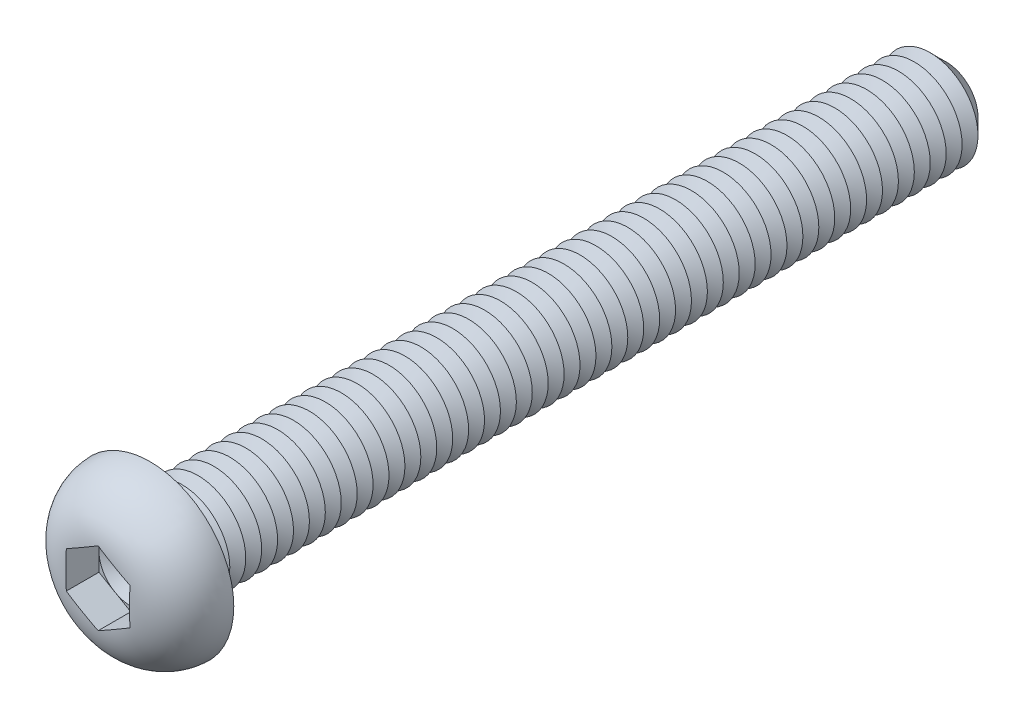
ISO-10303-21;
HEADER;
FILE_DESCRIPTION(('STEP AP214'),'2;1');
FILE_NAME('part.step','',(''),(''),'','','');
FILE_SCHEMA(('AUTOMOTIVE_DESIGN { 1 0 10303 214 1 1 1 1 }'));
ENDSEC;
DATA;
#1=APPLICATION_CONTEXT('core data for automotive mechanical design processes');
#2=APPLICATION_PROTOCOL_DEFINITION('international standard','automotive_design',2000,#1);
#3=PRODUCT_CONTEXT('',#1,'mechanical');
#4=PRODUCT('Part','Part','',(#3));
#5=PRODUCT_RELATED_PRODUCT_CATEGORY('part','',(#4));
#6=PRODUCT_DEFINITION_FORMATION('','',#4);
#7=PRODUCT_DEFINITION_CONTEXT('part definition',#1,'design');
#8=PRODUCT_DEFINITION('design','',#6,#7);
#9=PRODUCT_DEFINITION_SHAPE('','',#8);
#10=(LENGTH_UNIT() NAMED_UNIT(*) SI_UNIT(.MILLI.,.METRE.));
#11=(NAMED_UNIT(*) PLANE_ANGLE_UNIT() SI_UNIT($,.RADIAN.));
#12=(NAMED_UNIT(*) SI_UNIT($,.STERADIAN.) SOLID_ANGLE_UNIT());
#13=UNCERTAINTY_MEASURE_WITH_UNIT(LENGTH_MEASURE(1.E-05),#10,'distance_accuracy_value','');
#14=(GEOMETRIC_REPRESENTATION_CONTEXT(3) GLOBAL_UNCERTAINTY_ASSIGNED_CONTEXT((#13)) GLOBAL_UNIT_ASSIGNED_CONTEXT((#10,
#11,#12)) REPRESENTATION_CONTEXT('',''));
#15=CARTESIAN_POINT('',(0.,0.,0.));
#16=DIRECTION('',(0.,0.,1.));
#17=DIRECTION('',(1.,0.,0.));
#18=AXIS2_PLACEMENT_3D('',#15,#16,#17);
#19=CARTESIAN_POINT('',(0.,0.,1.22));
#20=DIRECTION('',(0.,0.,1.));
#21=DIRECTION('',(1.,0.,0.));
#22=AXIS2_PLACEMENT_3D('',#19,#20,#21);
#23=PLANE('',#22);
#24=CARTESIAN_POINT('',(0.,0.,1.22));
#25=DIRECTION('',(0.,0.,1.));
#26=DIRECTION('',(1.,0.,0.));
#27=AXIS2_PLACEMENT_3D('',#24,#25,#26);
#28=CIRCLE('',#27,2.);
#29=CARTESIAN_POINT('',(2.,0.,1.22));
#30=VERTEX_POINT('',#29);
#31=CARTESIAN_POINT('',(1.,1.73205080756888,1.22));
#32=VERTEX_POINT('',#31);
#33=EDGE_CURVE('E117',#30,#32,#28,.T.);
#34=ORIENTED_EDGE('',*,*,#33,.F.);
#35=DIRECTION('',(0.,1.,0.));
#36=VECTOR('',#35,1.);
#37=CARTESIAN_POINT('',(2.,-1.15470053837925,1.22));
#38=LINE('',#37,#36);
#39=CARTESIAN_POINT('',(2.,1.15470053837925,1.22));
#40=VERTEX_POINT('',#39);
#41=EDGE_CURVE('E140',#30,#40,#38,.T.);
#42=ORIENTED_EDGE('',*,*,#41,.T.);
#43=DIRECTION('',(-0.866025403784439,0.5,0.));
#44=VECTOR('',#43,1.);
#45=CARTESIAN_POINT('',(2.,1.15470053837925,1.22));
#46=LINE('',#45,#44);
#47=EDGE_CURVE('E136',#40,#32,#46,.T.);
#48=ORIENTED_EDGE('',*,*,#47,.T.);
#49=EDGE_LOOP('',(#34,#42,#48));
#50=FACE_BOUND('',#49,.T.);
#51=ADVANCED_FACE('F39',(#50),#23,.T.);
#52=CARTESIAN_POINT('',(0.,0.,1.22));
#53=DIRECTION('',(0.,0.,1.));
#54=DIRECTION('',(1.,0.,0.));
#55=AXIS2_PLACEMENT_3D('',#52,#53,#54);
#56=CIRCLE('',#55,2.);
#57=CARTESIAN_POINT('',(-1.,1.73205080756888,1.22));
#58=VERTEX_POINT('',#57);
#59=EDGE_CURVE('E11',#32,#58,#56,.T.);
#60=ORIENTED_EDGE('',*,*,#59,.F.);
#61=CARTESIAN_POINT('',(0.,2.3094010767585,1.22));
#62=VERTEX_POINT('',#61);
#63=EDGE_CURVE('E130',#32,#62,#46,.T.);
#64=ORIENTED_EDGE('',*,*,#63,.T.);
#65=DIRECTION('',(-0.866025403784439,-0.5,0.));
#66=VECTOR('',#65,1.);
#67=CARTESIAN_POINT('',(0.,2.3094010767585,1.22));
#68=LINE('',#67,#66);
#69=EDGE_CURVE('E131',#62,#58,#68,.T.);
#70=ORIENTED_EDGE('',*,*,#69,.T.);
#71=EDGE_LOOP('',(#60,#64,#70));
#72=FACE_BOUND('',#71,.T.);
#73=ADVANCED_FACE('F129',(#72),#23,.T.);
#74=CARTESIAN_POINT('',(-2.,0.,1.22));
#75=VERTEX_POINT('',#74);
#76=EDGE_CURVE('E49',#58,#75,#56,.T.);
#77=ORIENTED_EDGE('',*,*,#76,.F.);
#78=CARTESIAN_POINT('',(-2.,1.15470053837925,1.22));
#79=VERTEX_POINT('',#78);
#80=EDGE_CURVE('E143',#58,#79,#68,.T.);
#81=ORIENTED_EDGE('',*,*,#80,.T.);
#82=DIRECTION('',(0.,-1.,0.));
#83=VECTOR('',#82,1.);
#84=CARTESIAN_POINT('',(-2.,1.15470053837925,1.22));
#85=LINE('',#84,#83);
#86=EDGE_CURVE('E152',#79,#75,#85,.T.);
#87=ORIENTED_EDGE('',*,*,#86,.T.);
#88=EDGE_LOOP('',(#77,#81,#87));
#89=FACE_BOUND('',#88,.T.);
#90=ADVANCED_FACE('F269',(#89),#23,.T.);
#91=CARTESIAN_POINT('',(-1.,-1.73205080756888,1.22));
#92=VERTEX_POINT('',#91);
#93=EDGE_CURVE('E253',#75,#92,#56,.T.);
#94=ORIENTED_EDGE('',*,*,#93,.F.);
#95=CARTESIAN_POINT('',(-2.,-1.15470053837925,1.22));
#96=VERTEX_POINT('',#95);
#97=EDGE_CURVE('E151',#75,#96,#85,.T.);
#98=ORIENTED_EDGE('',*,*,#97,.T.);
#99=DIRECTION('',(0.866025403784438,-0.5,0.));
#100=VECTOR('',#99,1.);
#101=CARTESIAN_POINT('',(-2.,-1.15470053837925,1.22));
#102=LINE('',#101,#100);
#103=EDGE_CURVE('E157',#96,#92,#102,.T.);
#104=ORIENTED_EDGE('',*,*,#103,.T.);
#105=EDGE_LOOP('',(#94,#98,#104));
#106=FACE_BOUND('',#105,.T.);
#107=ADVANCED_FACE('F263',(#106),#23,.T.);
#108=CARTESIAN_POINT('',(0.999999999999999,-1.73205080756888,1.22));
#109=VERTEX_POINT('',#108);
#110=EDGE_CURVE('E56',#92,#109,#56,.T.);
#111=ORIENTED_EDGE('',*,*,#110,.F.);
#112=CARTESIAN_POINT('',(0.,-2.3094010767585,1.22));
#113=VERTEX_POINT('',#112);
#114=EDGE_CURVE('E156',#92,#113,#102,.T.);
#115=ORIENTED_EDGE('',*,*,#114,.T.);
#116=DIRECTION('',(0.866025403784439,0.5,0.));
#117=VECTOR('',#116,1.);
#118=CARTESIAN_POINT('',(0.,-2.3094010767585,1.22));
#119=LINE('',#118,#117);
#120=EDGE_CURVE('E162',#113,#109,#119,.T.);
#121=ORIENTED_EDGE('',*,*,#120,.T.);
#122=EDGE_LOOP('',(#111,#115,#121));
#123=FACE_BOUND('',#122,.T.);
#124=ADVANCED_FACE('F305',(#123),#23,.T.);
#125=CARTESIAN_POINT('',(0.,0.,-50.));
#126=DIRECTION('',(0.,0.,1.));
#127=DIRECTION('',(1.,0.,0.));
#128=AXIS2_PLACEMENT_3D('',#125,#126,#127);
#129=CYLINDRICAL_SURFACE('',#128,3.);
#130=CARTESIAN_POINT('',(0.,0.,-0.5));
#131=DIRECTION('',(0.,0.,1.));
#132=DIRECTION('',(1.,0.,0.));
#133=AXIS2_PLACEMENT_3D('',#130,#131,#132);
#134=CIRCLE('',#133,3.);
#135=CARTESIAN_POINT('',(3.,0.,-0.5));
#136=VERTEX_POINT('',#135);
#137=EDGE_CURVE('E241',#136,#136,#134,.F.);
#138=ORIENTED_EDGE('',*,*,#137,.T.);
#139=EDGE_LOOP('',(#138));
#140=FACE_BOUND('',#139,.T.);
#141=CARTESIAN_POINT('',(0.,0.,-1.));
#142=DIRECTION('',(0.,0.,1.));
#143=DIRECTION('',(1.,0.,0.));
#144=AXIS2_PLACEMENT_3D('',#141,#142,#143);
#145=CIRCLE('',#144,3.00000000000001);
#146=CARTESIAN_POINT('',(3.00000000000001,0.,-1.));
#147=VERTEX_POINT('',#146);
#148=EDGE_CURVE('E138',#147,#147,#145,.T.);
#149=ORIENTED_EDGE('',*,*,#148,.T.);
#150=EDGE_LOOP('',(#149));
#151=FACE_BOUND('',#150,.T.);
#152=ADVANCED_FACE('F306',(#140,#151),#129,.T.);
#153=CARTESIAN_POINT('',(0.,5.25,0.));
#154=DIRECTION('',(0.,0.,1.));
#155=DIRECTION('',(1.,0.,0.));
#156=AXIS2_PLACEMENT_3D('',#153,#154,#155);
#157=PLANE('',#156);
#158=CARTESIAN_POINT('',(0.,0.,0.));
#159=DIRECTION('',(0.,0.,1.));
#160=DIRECTION('',(1.,0.,0.));
#161=AXIS2_PLACEMENT_3D('',#158,#159,#160);
#162=CIRCLE('',#161,3.5);
#163=CARTESIAN_POINT('',(3.5,0.,0.));
#164=VERTEX_POINT('',#163);
#165=EDGE_CURVE('E244',#164,#164,#162,.T.);
#166=ORIENTED_EDGE('',*,*,#165,.T.);
#167=EDGE_LOOP('',(#166));
#168=FACE_BOUND('',#167,.T.);
#169=CARTESIAN_POINT('',(0.,0.,0.));
#170=DIRECTION('',(0.,0.,1.));
#171=DIRECTION('',(1.,0.,0.));
#172=AXIS2_PLACEMENT_3D('',#169,#170,#171);
#173=CIRCLE('',#172,5.25);
#174=CARTESIAN_POINT('',(5.25,0.,0.));
#175=VERTEX_POINT('',#174);
#176=EDGE_CURVE('E173',#175,#175,#173,.T.);
#177=ORIENTED_EDGE('',*,*,#176,.F.);
#178=EDGE_LOOP('',(#177));
#179=FACE_BOUND('',#178,.T.);
#180=ADVANCED_FACE('F309',(#168,#179),#157,.F.);
#181=CARTESIAN_POINT('',(0.,0.,-0.0999999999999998));
#182=DIRECTION('',(0.,0.,1.));
#183=DIRECTION('',(1.,0.,0.));
#184=AXIS2_PLACEMENT_3D('',#181,#182,#183);
#185=DEGENERATE_TOROIDAL_SURFACE('',#184,1.85147090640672,3.4,.T.);
#186=CARTESIAN_POINT('',(-2.0002,1.15458506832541,3.26900492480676));
#187=CARTESIAN_POINT('',(-1.91694658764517,1.20265144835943,3.27552708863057));
#188=CARTESIAN_POINT('',(-1.83362001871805,1.25076006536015,3.28041849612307));
#189=CARTESIAN_POINT('',(-1.66691146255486,1.34700929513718,3.28784569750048));
#190=CARTESIAN_POINT('',(-1.58352950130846,1.39514989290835,3.29038223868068));
#191=CARTESIAN_POINT('',(-1.4167967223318,1.49141310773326,3.29400753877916));
#192=CARTESIAN_POINT('',(-1.33344591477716,1.5395357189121,3.29509714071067));
#193=CARTESIAN_POINT('',(-1.16673007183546,1.63578915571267,3.29647051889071));
#194=CARTESIAN_POINT('',(-1.08336503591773,1.68391998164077,3.29675420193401));
#195=CARTESIAN_POINT('',(-0.916634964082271,1.78018163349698,3.29675420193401));
#196=CARTESIAN_POINT('',(-0.833269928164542,1.82831245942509,3.29647051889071));
#197=CARTESIAN_POINT('',(-0.666554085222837,1.92456589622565,3.29509714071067));
#198=CARTESIAN_POINT('',(-0.583203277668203,1.9726885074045,3.29400753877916));
#199=CARTESIAN_POINT('',(-0.416470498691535,2.06895172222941,3.29038223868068));
#200=CARTESIAN_POINT('',(-0.333088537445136,2.11709232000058,3.28784569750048));
#201=CARTESIAN_POINT('',(-0.166379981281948,2.21334154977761,3.28041849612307));
#202=CARTESIAN_POINT('',(-0.0830534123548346,2.26145016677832,3.27552708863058));
#203=CARTESIAN_POINT('',(0.000200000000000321,2.30951654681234,3.26900492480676));
#204=B_SPLINE_CURVE_WITH_KNOTS('',3,(#186,#187,#188,#189,#190,#191,#192,#193,#194,#195,#196,
#197,#198,#199,#200,#201,#202,#203),.UNSPECIFIED.,.F.,.F.,(4,2,2,2,2,2,2,2,4),(0.,
0.289010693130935,0.57792963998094,0.866680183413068,1.15546411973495,1.44424805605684,
1.73299859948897,2.02191754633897,2.31092823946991),.UNSPECIFIED.);
#205=CARTESIAN_POINT('',(-2.,1.15470053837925,3.26902062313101));
#206=VERTEX_POINT('',#205);
#207=CARTESIAN_POINT('',(1.70733705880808E-11,2.30940107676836,3.2690206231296));
#208=VERTEX_POINT('',#207);
#209=EDGE_CURVE('E195',#206,#208,#204,.T.);
#210=ORIENTED_EDGE('',*,*,#209,.T.);
#211=CARTESIAN_POINT('',(-0.000199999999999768,2.30951654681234,3.26900492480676));
#212=CARTESIAN_POINT('',(0.0830534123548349,2.26145016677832,3.27552708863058));
#213=CARTESIAN_POINT('',(0.166379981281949,2.21334154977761,3.28041849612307));
#214=CARTESIAN_POINT('',(0.333088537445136,2.11709232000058,3.28784569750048));
#215=CARTESIAN_POINT('',(0.416470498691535,2.06895172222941,3.29038223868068));
#216=CARTESIAN_POINT('',(0.583203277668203,1.9726885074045,3.29400753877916));
#217=CARTESIAN_POINT('',(0.666554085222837,1.92456589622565,3.29509714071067));
#218=CARTESIAN_POINT('',(0.833269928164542,1.82831245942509,3.29647051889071));
#219=CARTESIAN_POINT('',(0.916634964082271,1.78018163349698,3.29675420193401));
#220=CARTESIAN_POINT('',(1.08336503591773,1.68391998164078,3.29675420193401));
#221=CARTESIAN_POINT('',(1.16673007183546,1.63578915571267,3.29647051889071));
#222=CARTESIAN_POINT('',(1.33344591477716,1.5395357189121,3.29509714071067));
#223=CARTESIAN_POINT('',(1.4167967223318,1.49141310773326,3.29400753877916));
#224=CARTESIAN_POINT('',(1.58352950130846,1.39514989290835,3.29038223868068));
#225=CARTESIAN_POINT('',(1.66691146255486,1.34700929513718,3.28784569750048));
#226=CARTESIAN_POINT('',(1.83362001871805,1.25076006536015,3.28041849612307));
#227=CARTESIAN_POINT('',(1.91694658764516,1.20265144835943,3.27552708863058));
#228=CARTESIAN_POINT('',(2.0002,1.15458506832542,3.26900492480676));
#229=B_SPLINE_CURVE_WITH_KNOTS('',3,(#211,#212,#213,#214,#215,#216,#217,#218,#219,#220,#221,
#222,#223,#224,#225,#226,#227,#228),.UNSPECIFIED.,.F.,.F.,(4,2,2,2,2,2,2,2,4),(0.,
0.289010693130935,0.577929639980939,0.866680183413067,1.15546411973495,1.44424805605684,
1.73299859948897,2.02191754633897,2.31092823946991),.UNSPECIFIED.);
#230=CARTESIAN_POINT('',(2.,1.15470053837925,3.26902062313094));
#231=VERTEX_POINT('',#230);
#232=EDGE_CURVE('E224',#208,#231,#229,.T.);
#233=ORIENTED_EDGE('',*,*,#232,.T.);
#234=CARTESIAN_POINT('',(2.,0.,3.29675420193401));
#235=CARTESIAN_POINT('',(2.,-0.0838690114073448,3.29675159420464));
#236=CARTESIAN_POINT('',(2.,-0.167737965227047,3.29653427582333));
#237=CARTESIAN_POINT('',(2.,-0.335473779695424,3.29552217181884));
#238=CARTESIAN_POINT('',(2.,-0.419340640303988,3.29472737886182));
#239=CARTESIAN_POINT('',(2.,-0.587092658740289,3.29218243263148));
#240=CARTESIAN_POINT('',(2.,-0.670977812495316,3.29043194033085));
#241=CARTESIAN_POINT('',(2.,-0.838702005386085,3.28542814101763));
#242=CARTESIAN_POINT('',(2.,-0.922541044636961,3.28217483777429));
#243=CARTESIAN_POINT('',(2.,-1.173343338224,3.26923984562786));
#244=CARTESIAN_POINT('',(2.,-1.34017699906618,3.25638268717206));
#245=CARTESIAN_POINT('',(2.,-1.67225876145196,3.21731215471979));
#246=CARTESIAN_POINT('',(2.,-1.83750825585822,3.19111187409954));
#247=CARTESIAN_POINT('',(2.,-2.10571503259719,3.13417573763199));
#248=CARTESIAN_POINT('',(2.,-2.20973442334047,3.10844622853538));
#249=CARTESIAN_POINT('',(2.,-2.41562153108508,3.04936015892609));
#250=CARTESIAN_POINT('',(2.,-2.51748898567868,3.01600267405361));
#251=CARTESIAN_POINT('',(2.,-2.71832295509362,2.94120377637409));
#252=CARTESIAN_POINT('',(2.,-2.81728700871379,2.89975572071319));
#253=CARTESIAN_POINT('',(2.,-3.01134256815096,2.80859624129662));
#254=CARTESIAN_POINT('',(2.,-3.10643425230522,2.75888519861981));
#255=CARTESIAN_POINT('',(2.,-3.29253530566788,2.65079509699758));
#256=CARTESIAN_POINT('',(2.,-3.38350832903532,2.59235327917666));
#257=CARTESIAN_POINT('',(2.,-3.55964478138,2.46728791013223));
#258=CARTESIAN_POINT('',(2.,-3.64480873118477,2.40066509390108));
#259=CARTESIAN_POINT('',(2.,-3.80840353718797,2.25961603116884));
#260=CARTESIAN_POINT('',(2.,-3.88683504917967,2.18519054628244));
#261=CARTESIAN_POINT('',(2.,-4.03608847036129,2.02906828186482));
#262=CARTESIAN_POINT('',(2.,-4.106911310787,1.94737239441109));
#263=CARTESIAN_POINT('',(2.,-4.23287471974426,1.78665318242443));
#264=CARTESIAN_POINT('',(2.,-4.2888832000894,1.7083085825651));
#265=CARTESIAN_POINT('',(2.,-4.39372062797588,1.54691061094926));
#266=CARTESIAN_POINT('',(2.,-4.44254705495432,1.46385560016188));
#267=CARTESIAN_POINT('',(2.,-4.53249771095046,1.29375158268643));
#268=CARTESIAN_POINT('',(2.,-4.57362814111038,1.20670586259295));
#269=CARTESIAN_POINT('',(2.,-4.6478549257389,1.02924414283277));
#270=CARTESIAN_POINT('',(2.,-4.68094842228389,0.938826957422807));
#271=CARTESIAN_POINT('',(2.,-4.76413649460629,0.674747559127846));
#272=CARTESIAN_POINT('',(2.,-4.80368573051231,0.497625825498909));
#273=CARTESIAN_POINT('',(2.,-4.85179982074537,0.13932226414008));
#274=CARTESIAN_POINT('',(2.,-4.86036774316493,-0.0418591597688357));
#275=CARTESIAN_POINT('',(2.,-4.84642577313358,-0.399473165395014));
#276=CARTESIAN_POINT('',(2.,-4.82452156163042,-0.575929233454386));
#277=CARTESIAN_POINT('',(2.,-4.75142809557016,-0.922615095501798));
#278=CARTESIAN_POINT('',(2.,-4.70024536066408,-1.09284626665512));
#279=CARTESIAN_POINT('',(2.,-4.57020203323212,-1.42258491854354));
#280=CARTESIAN_POINT('',(2.,-4.49131097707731,-1.58208036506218));
#281=CARTESIAN_POINT('',(2.,-4.3083542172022,-1.8860021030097));
#282=CARTESIAN_POINT('',(2.,-4.2042742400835,-2.03041978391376));
#283=CARTESIAN_POINT('',(2.,-3.97174533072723,-2.30354399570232));
#284=CARTESIAN_POINT('',(2.,-3.84281347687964,-2.43183812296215));
#285=CARTESIAN_POINT('',(2.,-3.56631740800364,-2.66612298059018));
#286=CARTESIAN_POINT('',(2.,-3.41877418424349,-2.77213848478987));
#287=CARTESIAN_POINT('',(2.,-3.18261597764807,-2.91604941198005));
#288=CARTESIAN_POINT('',(2.,-3.09905663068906,-2.96247915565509));
#289=CARTESIAN_POINT('',(2.,-2.92856838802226,-3.04879370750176));
#290=CARTESIAN_POINT('',(2.,-2.84163827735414,-3.08867612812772));
#291=CARTESIAN_POINT('',(2.,-2.66495003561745,-3.16199567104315));
#292=CARTESIAN_POINT('',(2.,-2.57518752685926,-3.19542218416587));
#293=CARTESIAN_POINT('',(2.,-2.3936698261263,-3.25594506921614));
#294=CARTESIAN_POINT('',(2.,-2.30191676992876,-3.28304789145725));
#295=CARTESIAN_POINT('',(2.,-2.07265810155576,-3.34285611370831));
#296=CARTESIAN_POINT('',(2.,-1.93423373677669,-3.37205334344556));
#297=CARTESIAN_POINT('',(2.,-1.65546420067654,-3.419280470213));
#298=CARTESIAN_POINT('',(2.,-1.51511762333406,-3.43730169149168));
#299=CARTESIAN_POINT('',(2.,-1.23291689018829,-3.46473877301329));
#300=CARTESIAN_POINT('',(2.,-1.09105869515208,-3.47411015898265));
#301=CARTESIAN_POINT('',(2.,-0.807138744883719,-3.48717303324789));
#302=CARTESIAN_POINT('',(2.,-0.665077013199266,-3.4908651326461));
#303=CARTESIAN_POINT('',(2.,-0.451303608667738,-3.49429675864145));
#304=CARTESIAN_POINT('',(2.,-0.379602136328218,-3.49508825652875));
#305=CARTESIAN_POINT('',(2.,-0.236195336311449,-3.49619580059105));
#306=CARTESIAN_POINT('',(2.,-0.164490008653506,-3.49651184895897));
#307=CARTESIAN_POINT('',(2.,-0.0210718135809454,-3.49680708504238));
#308=CARTESIAN_POINT('',(2.,0.0506410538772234,-3.49678623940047));
#309=CARTESIAN_POINT('',(2.,0.194065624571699,-3.49639104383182));
#310=CARTESIAN_POINT('',(2.,0.265777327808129,-3.49601669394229));
#311=CARTESIAN_POINT('',(2.,0.480501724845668,-3.4941697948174));
#312=CARTESIAN_POINT('',(2.,0.623510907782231,-3.49197539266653));
#313=CARTESIAN_POINT('',(2.,0.909378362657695,-3.48318258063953));
#314=CARTESIAN_POINT('',(2.,1.05223667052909,-3.47658576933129));
#315=CARTESIAN_POINT('',(2.,1.30726724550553,-3.45800282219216));
#316=CARTESIAN_POINT('',(2.,1.41953767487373,-3.44745204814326));
#317=CARTESIAN_POINT('',(2.,1.64336701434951,-3.42020385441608));
#318=CARTESIAN_POINT('',(2.,1.75492585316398,-3.40350582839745));
#319=CARTESIAN_POINT('',(2.,1.97590795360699,-3.36293007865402));
#320=CARTESIAN_POINT('',(2.,2.08534088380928,-3.33910600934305));
#321=CARTESIAN_POINT('',(2.,2.30216001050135,-3.28336687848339));
#322=CARTESIAN_POINT('',(2.,2.40954602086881,-3.25145108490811));
#323=CARTESIAN_POINT('',(2.,2.62289868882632,-3.1784271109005));
#324=CARTESIAN_POINT('',(2.,2.72882262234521,-3.13719314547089));
#325=CARTESIAN_POINT('',(2.,2.93660837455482,-3.04548652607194));
#326=CARTESIAN_POINT('',(2.,3.03847031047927,-2.99501413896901));
#327=CARTESIAN_POINT('',(2.,3.23738754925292,-2.88459171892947));
#328=CARTESIAN_POINT('',(2.,3.33442546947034,-2.82461027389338));
#329=CARTESIAN_POINT('',(2.,3.52225616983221,-2.69545434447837));
#330=CARTESIAN_POINT('',(2.,3.61304636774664,-2.62627609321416));
#331=CARTESIAN_POINT('',(2.,3.77958578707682,-2.48563135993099));
#332=CARTESIAN_POINT('',(2.,3.85595570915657,-2.41489922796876));
#333=CARTESIAN_POINT('',(2.,4.00175744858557,-2.26661746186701));
#334=CARTESIAN_POINT('',(2.,4.07118992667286,-2.18906847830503));
#335=CARTESIAN_POINT('',(2.,4.20228235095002,-2.02784942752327));
#336=CARTESIAN_POINT('',(2.,4.26395450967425,-1.94418931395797));
#337=CARTESIAN_POINT('',(2.,4.37897455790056,-1.7713710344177));
#338=CARTESIAN_POINT('',(2.,4.43232318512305,-1.68221335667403));
#339=CARTESIAN_POINT('',(2.,4.5685109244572,-1.42722170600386));
#340=CARTESIAN_POINT('',(2.,4.64167742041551,-1.25607726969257));
#341=CARTESIAN_POINT('',(2.,4.75695354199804,-0.903699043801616));
#342=CARTESIAN_POINT('',(2.,4.79906366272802,-0.722465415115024));
#343=CARTESIAN_POINT('',(2.,4.84982785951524,-0.362243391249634));
#344=CARTESIAN_POINT('',(2.,4.85966759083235,-0.183422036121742));
#345=CARTESIAN_POINT('',(2.,4.84889099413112,0.17327689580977));
#346=CARTESIAN_POINT('',(2.,4.82827907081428,0.351154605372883));
#347=CARTESIAN_POINT('',(2.,4.75760776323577,0.699332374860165));
#348=CARTESIAN_POINT('',(2.,4.70780624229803,0.869684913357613));
#349=CARTESIAN_POINT('',(2.,4.58058971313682,1.199716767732));
#350=CARTESIAN_POINT('',(2.,4.50317623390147,1.35939667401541));
#351=CARTESIAN_POINT('',(2.,4.32230037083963,1.66542907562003));
#352=CARTESIAN_POINT('',(2.,4.21858077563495,1.81162931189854));
#353=CARTESIAN_POINT('',(2.,3.98879583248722,2.08527000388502));
#354=CARTESIAN_POINT('',(2.,3.86272429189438,2.21270524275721));
#355=CARTESIAN_POINT('',(2.,3.58743550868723,2.45020985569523));
#356=CARTESIAN_POINT('',(2.,3.43756474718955,2.55951924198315));
#357=CARTESIAN_POINT('',(2.,3.12282273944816,2.7535430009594));
#358=CARTESIAN_POINT('',(2.,2.95795742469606,2.83826704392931));
#359=CARTESIAN_POINT('',(2.,2.67096435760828,2.96064273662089));
#360=CARTESIAN_POINT('',(2.,2.55150855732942,3.00473766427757));
#361=CARTESIAN_POINT('',(2.,2.30905936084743,3.08191633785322));
#362=CARTESIAN_POINT('',(2.,2.18606487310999,3.11499664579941));
#363=CARTESIAN_POINT('',(2.,1.93761764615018,3.17114962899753));
#364=CARTESIAN_POINT('',(2.,1.8121607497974,3.19420352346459));
#365=CARTESIAN_POINT('',(2.,1.56000755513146,3.23170431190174));
#366=CARTESIAN_POINT('',(2.,1.43331126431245,3.24615125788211));
#367=CARTESIAN_POINT('',(2.,1.19785080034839,3.26676473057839));
#368=CARTESIAN_POINT('',(2.,1.08915974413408,3.27383022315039));
#369=CARTESIAN_POINT('',(2.,0.87159878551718,3.28448481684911));
#370=CARTESIAN_POINT('',(2.,0.762728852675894,3.28807324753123));
#371=CARTESIAN_POINT('',(2.,0.54488171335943,3.29312180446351));
#372=CARTESIAN_POINT('',(2.,0.435904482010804,3.29458062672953));
#373=CARTESIAN_POINT('',(2.,0.217951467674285,3.29639847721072));
#374=CARTESIAN_POINT('',(2.,0.108975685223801,3.29675759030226));
#375=CARTESIAN_POINT('',(2.,0.,3.29675420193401));
#376=B_SPLINE_CURVE_WITH_KNOTS('',3,(#234,#235,#236,#237,#238,#239,#240,#241,#242,#243,#244,
#245,#246,#247,#248,#249,#250,#251,#252,#253,#254,#255,#256,#257,#258,#259,#260,#261,#262,#263,
#264,#265,#266,#267,#268,#269,#270,#271,#272,#273,#274,#275,#276,#277,#278,#279,#280,#281,#282,
#283,#284,#285,#286,#287,#288,#289,#290,#291,#292,#293,#294,#295,#296,#297,#298,#299,#300,#301,
#302,#303,#304,#305,#306,#307,#308,#309,#310,#311,#312,#313,#314,#315,#316,#317,#318,#319,#320,
#321,#322,#323,#324,#325,#326,#327,#328,#329,#330,#331,#332,#333,#334,#335,#336,#337,#338,#339,
#340,#341,#342,#343,#344,#345,#346,#347,#348,#349,#350,#351,#352,#353,#354,#355,#356,#357,#358,
#359,#360,#361,#362,#363,#364,#365,#366,#367,#368,#369,#370,#371,#372,#373,#374,#375),
.UNSPECIFIED.,.T.,.F.,(4,2,2,2,2,2,2,2,2,2,2,2,2,2,2,2,2,2,2,2,2,2,2,2,2,2,2,2,2,2,2,2,2,2,2,2,
2,2,2,2,2,2,2,2,2,2,2,2,2,2,2,2,2,2,2,2,2,2,2,2,2,2,2,2,2,2,2,2,2,2,4),(0.,0.251606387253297,
0.503215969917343,0.754914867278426,1.00661313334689,1.50825543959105,2.00940643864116,
2.33061510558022,2.65186271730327,2.97337521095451,3.29487288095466,3.61880390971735,
3.94270585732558,4.26657621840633,4.59040689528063,4.8789527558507,5.16759964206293,
5.45601293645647,5.74452864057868,6.28608750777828,6.82759274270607,7.35848716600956,
7.8892634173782,8.42062506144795,8.95228851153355,9.49557283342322,10.0382497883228,
10.3247866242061,10.6114277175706,10.8985359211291,11.1853499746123,11.6091713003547,
12.0333212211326,12.4596400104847,12.8859129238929,13.1010304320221,13.316146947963,
13.5312847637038,13.746422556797,14.1754765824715,14.6043748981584,14.9425387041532,
15.2807358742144,15.6164481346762,15.9521907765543,16.2927694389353,16.6333382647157,
16.9750565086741,17.3169151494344,17.6287548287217,17.9405647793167,18.2518777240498,
18.5631630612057,19.1185081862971,19.6738444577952,20.20853386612,20.7431459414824,
21.2731049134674,21.8030345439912,22.3383600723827,22.8738341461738,23.4279697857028,
23.9818871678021,24.3633752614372,24.7449823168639,25.1273011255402,25.5096176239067,
25.8363061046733,26.163057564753,26.4900090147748,26.8169352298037),.UNSPECIFIED.);
#377=CARTESIAN_POINT('',(2.,-1.15470053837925,3.26902062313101));
#378=VERTEX_POINT('',#377);
#379=EDGE_CURVE('E233',#231,#378,#376,.T.);
#380=ORIENTED_EDGE('',*,*,#379,.T.);
#381=CARTESIAN_POINT('',(2.0002,-1.15458506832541,3.26900492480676));
#382=CARTESIAN_POINT('',(1.91694658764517,-1.20265144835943,3.27552708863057));
#383=CARTESIAN_POINT('',(1.83362001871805,-1.25076006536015,3.28041849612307));
#384=CARTESIAN_POINT('',(1.66691146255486,-1.34700929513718,3.28784569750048));
#385=CARTESIAN_POINT('',(1.58352950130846,-1.39514989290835,3.29038223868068));
#386=CARTESIAN_POINT('',(1.4167967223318,-1.49141310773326,3.29400753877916));
#387=CARTESIAN_POINT('',(1.33344591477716,-1.5395357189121,3.29509714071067));
#388=CARTESIAN_POINT('',(1.16673007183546,-1.63578915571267,3.29647051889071));
#389=CARTESIAN_POINT('',(1.08336503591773,-1.68391998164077,3.29675420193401));
#390=CARTESIAN_POINT('',(0.916634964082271,-1.78018163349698,3.29675420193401));
#391=CARTESIAN_POINT('',(0.833269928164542,-1.82831245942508,3.29647051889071));
#392=CARTESIAN_POINT('',(0.666554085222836,-1.92456589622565,3.29509714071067));
#393=CARTESIAN_POINT('',(0.583203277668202,-1.97268850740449,3.29400753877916));
#394=CARTESIAN_POINT('',(0.416470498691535,-2.06895172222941,3.29038223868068));
#395=CARTESIAN_POINT('',(0.333088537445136,-2.11709232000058,3.28784569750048));
#396=CARTESIAN_POINT('',(0.166379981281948,-2.2133415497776,3.28041849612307));
#397=CARTESIAN_POINT('',(0.0830534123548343,-2.26145016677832,3.27552708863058));
#398=CARTESIAN_POINT('',(-0.000200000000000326,-2.30951654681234,3.26900492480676));
#399=B_SPLINE_CURVE_WITH_KNOTS('',3,(#381,#382,#383,#384,#385,#386,#387,#388,#389,#390,#391,
#392,#393,#394,#395,#396,#397,#398),.UNSPECIFIED.,.F.,.F.,(4,2,2,2,2,2,2,2,4),(0.,
0.289010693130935,0.57792963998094,0.866680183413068,1.15546411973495,1.44424805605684,
1.73299859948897,2.02191754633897,2.31092823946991),.UNSPECIFIED.);
#400=CARTESIAN_POINT('',(0.,-2.3094010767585,3.26902062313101));
#401=VERTEX_POINT('',#400);
#402=EDGE_CURVE('E279',#378,#401,#399,.T.);
#403=ORIENTED_EDGE('',*,*,#402,.T.);
#404=CARTESIAN_POINT('',(0.000199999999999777,-2.30951654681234,3.26900492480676));
#405=CARTESIAN_POINT('',(-0.083053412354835,-2.26145016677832,3.27552708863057));
#406=CARTESIAN_POINT('',(-0.166379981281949,-2.21334154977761,3.28041849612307));
#407=CARTESIAN_POINT('',(-0.333088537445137,-2.11709232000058,3.28784569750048));
#408=CARTESIAN_POINT('',(-0.416470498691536,-2.06895172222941,3.29038223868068));
#409=CARTESIAN_POINT('',(-0.583203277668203,-1.97268850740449,3.29400753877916));
#410=CARTESIAN_POINT('',(-0.666554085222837,-1.92456589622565,3.29509714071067));
#411=CARTESIAN_POINT('',(-0.833269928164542,-1.82831245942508,3.29647051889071));
#412=CARTESIAN_POINT('',(-0.916634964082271,-1.78018163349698,3.29675420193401));
#413=CARTESIAN_POINT('',(-1.08336503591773,-1.68391998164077,3.29675420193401));
#414=CARTESIAN_POINT('',(-1.16673007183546,-1.63578915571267,3.29647051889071));
#415=CARTESIAN_POINT('',(-1.33344591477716,-1.5395357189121,3.29509714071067));
#416=CARTESIAN_POINT('',(-1.4167967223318,-1.49141310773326,3.29400753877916));
#417=CARTESIAN_POINT('',(-1.58352950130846,-1.39514989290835,3.29038223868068));
#418=CARTESIAN_POINT('',(-1.66691146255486,-1.34700929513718,3.28784569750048));
#419=CARTESIAN_POINT('',(-1.83362001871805,-1.25076006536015,3.28041849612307));
#420=CARTESIAN_POINT('',(-1.91694658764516,-1.20265144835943,3.27552708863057));
#421=CARTESIAN_POINT('',(-2.0002,-1.15458506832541,3.26900492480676));
#422=B_SPLINE_CURVE_WITH_KNOTS('',3,(#404,#405,#406,#407,#408,#409,#410,#411,#412,#413,#414,
#415,#416,#417,#418,#419,#420,#421),.UNSPECIFIED.,.F.,.F.,(4,2,2,2,2,2,2,2,4),(0.,
0.289010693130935,0.577929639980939,0.866680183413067,1.15546411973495,1.44424805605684,
1.73299859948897,2.02191754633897,2.31092823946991),.UNSPECIFIED.);
#423=CARTESIAN_POINT('',(-2.,-1.15470053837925,3.26902062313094));
#424=VERTEX_POINT('',#423);
#425=EDGE_CURVE('E276',#401,#424,#422,.T.);
#426=ORIENTED_EDGE('',*,*,#425,.T.);
#427=CARTESIAN_POINT('',(-2.,0.,3.29675420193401));
#428=CARTESIAN_POINT('',(-2.,0.0838690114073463,3.29675159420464));
#429=CARTESIAN_POINT('',(-2.,0.167737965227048,3.29653427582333));
#430=CARTESIAN_POINT('',(-2.,0.335473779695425,3.29552217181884));
#431=CARTESIAN_POINT('',(-2.,0.41934064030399,3.29472737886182));
#432=CARTESIAN_POINT('',(-2.,0.58709265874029,3.29218243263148));
#433=CARTESIAN_POINT('',(-2.,0.670977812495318,3.29043194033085));
#434=CARTESIAN_POINT('',(-2.,0.838702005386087,3.28542814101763));
#435=CARTESIAN_POINT('',(-2.,0.922541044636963,3.28217483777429));
#436=CARTESIAN_POINT('',(-2.,1.173343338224,3.26923984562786));
#437=CARTESIAN_POINT('',(-2.,1.34017699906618,3.25638268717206));
#438=CARTESIAN_POINT('',(-2.,1.67225876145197,3.21731215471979));
#439=CARTESIAN_POINT('',(-2.,1.83750825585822,3.19111187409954));
#440=CARTESIAN_POINT('',(-2.,2.10571503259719,3.13417573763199));
#441=CARTESIAN_POINT('',(-2.,2.20973442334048,3.10844622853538));
#442=CARTESIAN_POINT('',(-2.,2.41562153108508,3.04936015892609));
#443=CARTESIAN_POINT('',(-2.,2.51748898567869,3.01600267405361));
#444=CARTESIAN_POINT('',(-2.,2.71832295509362,2.94120377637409));
#445=CARTESIAN_POINT('',(-2.,2.81728700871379,2.89975572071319));
#446=CARTESIAN_POINT('',(-2.,3.01134256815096,2.80859624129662));
#447=CARTESIAN_POINT('',(-2.,3.10643425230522,2.75888519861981));
#448=CARTESIAN_POINT('',(-2.,3.29253530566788,2.65079509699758));
#449=CARTESIAN_POINT('',(-2.,3.38350832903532,2.59235327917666));
#450=CARTESIAN_POINT('',(-2.,3.55964478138,2.46728791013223));
#451=CARTESIAN_POINT('',(-2.,3.64480873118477,2.40066509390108));
#452=CARTESIAN_POINT('',(-2.,3.80840353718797,2.25961603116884));
#453=CARTESIAN_POINT('',(-2.,3.88683504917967,2.18519054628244));
#454=CARTESIAN_POINT('',(-2.,4.03608847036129,2.02906828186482));
#455=CARTESIAN_POINT('',(-2.,4.106911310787,1.94737239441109));
#456=CARTESIAN_POINT('',(-2.,4.23287471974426,1.78665318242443));
#457=CARTESIAN_POINT('',(-2.,4.2888832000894,1.7083085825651));
#458=CARTESIAN_POINT('',(-2.,4.39372062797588,1.54691061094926));
#459=CARTESIAN_POINT('',(-2.,4.44254705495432,1.46385560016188));
#460=CARTESIAN_POINT('',(-2.,4.53249771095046,1.29375158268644));
#461=CARTESIAN_POINT('',(-2.,4.57362814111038,1.20670586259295));
#462=CARTESIAN_POINT('',(-2.,4.6478549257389,1.02924414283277));
#463=CARTESIAN_POINT('',(-2.,4.68094842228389,0.938826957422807));
#464=CARTESIAN_POINT('',(-2.,4.76413649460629,0.674747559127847));
#465=CARTESIAN_POINT('',(-2.,4.80368573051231,0.497625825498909));
#466=CARTESIAN_POINT('',(-2.,4.85179982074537,0.13932226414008));
#467=CARTESIAN_POINT('',(-2.,4.86036774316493,-0.0418591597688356));
#468=CARTESIAN_POINT('',(-2.,4.84642577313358,-0.399473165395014));
#469=CARTESIAN_POINT('',(-2.,4.82452156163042,-0.575929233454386));
#470=CARTESIAN_POINT('',(-2.,4.75142809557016,-0.922615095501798));
#471=CARTESIAN_POINT('',(-2.,4.70024536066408,-1.09284626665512));
#472=CARTESIAN_POINT('',(-2.,4.57020203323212,-1.42258491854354));
#473=CARTESIAN_POINT('',(-2.,4.49131097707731,-1.58208036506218));
#474=CARTESIAN_POINT('',(-2.,4.3083542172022,-1.8860021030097));
#475=CARTESIAN_POINT('',(-2.,4.2042742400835,-2.03041978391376));
#476=CARTESIAN_POINT('',(-2.,3.97174533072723,-2.30354399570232));
#477=CARTESIAN_POINT('',(-2.,3.84281347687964,-2.43183812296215));
#478=CARTESIAN_POINT('',(-2.,3.56631740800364,-2.66612298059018));
#479=CARTESIAN_POINT('',(-2.,3.41877418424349,-2.77213848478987));
#480=CARTESIAN_POINT('',(-2.,3.18261597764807,-2.91604941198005));
#481=CARTESIAN_POINT('',(-2.,3.09905663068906,-2.96247915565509));
#482=CARTESIAN_POINT('',(-2.,2.92856838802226,-3.04879370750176));
#483=CARTESIAN_POINT('',(-2.,2.84163827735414,-3.08867612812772));
#484=CARTESIAN_POINT('',(-2.,2.66495003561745,-3.16199567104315));
#485=CARTESIAN_POINT('',(-2.,2.57518752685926,-3.19542218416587));
#486=CARTESIAN_POINT('',(-2.,2.3936698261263,-3.25594506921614));
#487=CARTESIAN_POINT('',(-2.,2.30191676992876,-3.28304789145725));
#488=CARTESIAN_POINT('',(-2.,2.07265810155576,-3.34285611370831));
#489=CARTESIAN_POINT('',(-2.,1.93423373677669,-3.37205334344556));
#490=CARTESIAN_POINT('',(-2.,1.65546420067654,-3.419280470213));
#491=CARTESIAN_POINT('',(-2.,1.51511762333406,-3.43730169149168));
#492=CARTESIAN_POINT('',(-2.,1.23291689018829,-3.46473877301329));
#493=CARTESIAN_POINT('',(-2.,1.09105869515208,-3.47411015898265));
#494=CARTESIAN_POINT('',(-2.,0.807138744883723,-3.48717303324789));
#495=CARTESIAN_POINT('',(-2.,0.66507701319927,-3.4908651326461));
#496=CARTESIAN_POINT('',(-2.,0.451303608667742,-3.49429675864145));
#497=CARTESIAN_POINT('',(-2.,0.379602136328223,-3.49508825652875));
#498=CARTESIAN_POINT('',(-2.,0.236195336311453,-3.49619580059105));
#499=CARTESIAN_POINT('',(-2.,0.16449000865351,-3.49651184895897));
#500=CARTESIAN_POINT('',(-2.,0.0210718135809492,-3.49680708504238));
#501=CARTESIAN_POINT('',(-2.,-0.0506410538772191,-3.49678623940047));
#502=CARTESIAN_POINT('',(-2.,-0.194065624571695,-3.49639104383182));
#503=CARTESIAN_POINT('',(-2.,-0.265777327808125,-3.49601669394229));
#504=CARTESIAN_POINT('',(-2.,-0.480501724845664,-3.4941697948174));
#505=CARTESIAN_POINT('',(-2.,-0.623510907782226,-3.49197539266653));
#506=CARTESIAN_POINT('',(-2.,-0.909378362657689,-3.48318258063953));
#507=CARTESIAN_POINT('',(-2.,-1.05223667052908,-3.47658576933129));
#508=CARTESIAN_POINT('',(-2.,-1.30726724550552,-3.45800282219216));
#509=CARTESIAN_POINT('',(-2.,-1.41953767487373,-3.44745204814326));
#510=CARTESIAN_POINT('',(-2.,-1.6433670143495,-3.42020385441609));
#511=CARTESIAN_POINT('',(-2.,-1.75492585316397,-3.40350582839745));
#512=CARTESIAN_POINT('',(-2.,-1.97590795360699,-3.36293007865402));
#513=CARTESIAN_POINT('',(-2.,-2.08534088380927,-3.33910600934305));
#514=CARTESIAN_POINT('',(-2.,-2.30216001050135,-3.28336687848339));
#515=CARTESIAN_POINT('',(-2.,-2.4095460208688,-3.25145108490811));
#516=CARTESIAN_POINT('',(-2.,-2.62289868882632,-3.1784271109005));
#517=CARTESIAN_POINT('',(-2.,-2.72882262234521,-3.13719314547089));
#518=CARTESIAN_POINT('',(-2.,-2.93660837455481,-3.04548652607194));
#519=CARTESIAN_POINT('',(-2.,-3.03847031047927,-2.99501413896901));
#520=CARTESIAN_POINT('',(-2.,-3.23738754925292,-2.88459171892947));
#521=CARTESIAN_POINT('',(-2.,-3.33442546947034,-2.82461027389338));
#522=CARTESIAN_POINT('',(-2.,-3.52225616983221,-2.69545434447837));
#523=CARTESIAN_POINT('',(-2.,-3.61304636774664,-2.62627609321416));
#524=CARTESIAN_POINT('',(-2.,-3.77958578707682,-2.48563135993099));
#525=CARTESIAN_POINT('',(-2.,-3.85595570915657,-2.41489922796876));
#526=CARTESIAN_POINT('',(-2.,-4.00175744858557,-2.26661746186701));
#527=CARTESIAN_POINT('',(-2.,-4.07118992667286,-2.18906847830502));
#528=CARTESIAN_POINT('',(-2.,-4.20228235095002,-2.02784942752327));
#529=CARTESIAN_POINT('',(-2.,-4.26395450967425,-1.94418931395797));
#530=CARTESIAN_POINT('',(-2.,-4.37897455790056,-1.7713710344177));
#531=CARTESIAN_POINT('',(-2.,-4.43232318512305,-1.68221335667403));
#532=CARTESIAN_POINT('',(-2.,-4.5685109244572,-1.42722170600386));
#533=CARTESIAN_POINT('',(-2.,-4.64167742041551,-1.25607726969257));
#534=CARTESIAN_POINT('',(-2.,-4.75695354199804,-0.903699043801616));
#535=CARTESIAN_POINT('',(-2.,-4.79906366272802,-0.722465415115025));
#536=CARTESIAN_POINT('',(-2.,-4.84982785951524,-0.362243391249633));
#537=CARTESIAN_POINT('',(-2.,-4.85966759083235,-0.18342203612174));
#538=CARTESIAN_POINT('',(-2.,-4.84889099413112,0.173276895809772));
#539=CARTESIAN_POINT('',(-2.,-4.82827907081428,0.351154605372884));
#540=CARTESIAN_POINT('',(-2.,-4.75760776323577,0.699332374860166));
#541=CARTESIAN_POINT('',(-2.,-4.70780624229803,0.869684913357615));
#542=CARTESIAN_POINT('',(-2.,-4.58058971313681,1.199716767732));
#543=CARTESIAN_POINT('',(-2.,-4.50317623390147,1.35939667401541));
#544=CARTESIAN_POINT('',(-2.,-4.32230037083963,1.66542907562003));
#545=CARTESIAN_POINT('',(-2.,-4.21858077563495,1.81162931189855));
#546=CARTESIAN_POINT('',(-2.,-3.98879583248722,2.08527000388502));
#547=CARTESIAN_POINT('',(-2.,-3.86272429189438,2.21270524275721));
#548=CARTESIAN_POINT('',(-2.,-3.58743550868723,2.45020985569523));
#549=CARTESIAN_POINT('',(-2.,-3.43756474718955,2.55951924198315));
#550=CARTESIAN_POINT('',(-2.,-3.12282273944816,2.7535430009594));
#551=CARTESIAN_POINT('',(-2.,-2.95795742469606,2.8382670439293));
#552=CARTESIAN_POINT('',(-2.,-2.67096435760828,2.96064273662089));
#553=CARTESIAN_POINT('',(-2.,-2.55150855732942,3.00473766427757));
#554=CARTESIAN_POINT('',(-2.,-2.30905936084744,3.08191633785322));
#555=CARTESIAN_POINT('',(-2.,-2.18606487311,3.11499664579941));
#556=CARTESIAN_POINT('',(-2.,-1.93761764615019,3.17114962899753));
#557=CARTESIAN_POINT('',(-2.,-1.81216074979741,3.19420352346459));
#558=CARTESIAN_POINT('',(-2.,-1.56000755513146,3.23170431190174));
#559=CARTESIAN_POINT('',(-2.,-1.43331126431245,3.24615125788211));
#560=CARTESIAN_POINT('',(-2.,-1.19785080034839,3.26676473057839));
#561=CARTESIAN_POINT('',(-2.,-1.08915974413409,3.27383022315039));
#562=CARTESIAN_POINT('',(-2.,-0.871598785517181,3.28448481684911));
#563=CARTESIAN_POINT('',(-2.,-0.762728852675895,3.28807324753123));
#564=CARTESIAN_POINT('',(-2.,-0.54488171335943,3.29312180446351));
#565=CARTESIAN_POINT('',(-2.,-0.435904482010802,3.29458062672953));
#566=CARTESIAN_POINT('',(-2.,-0.217951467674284,3.29639847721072));
#567=CARTESIAN_POINT('',(-2.,-0.108975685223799,3.29675759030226));
#568=CARTESIAN_POINT('',(-2.,0.,3.29675420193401));
#569=B_SPLINE_CURVE_WITH_KNOTS('',3,(#427,#428,#429,#430,#431,#432,#433,#434,#435,#436,#437,
#438,#439,#440,#441,#442,#443,#444,#445,#446,#447,#448,#449,#450,#451,#452,#453,#454,#455,#456,
#457,#458,#459,#460,#461,#462,#463,#464,#465,#466,#467,#468,#469,#470,#471,#472,#473,#474,#475,
#476,#477,#478,#479,#480,#481,#482,#483,#484,#485,#486,#487,#488,#489,#490,#491,#492,#493,#494,
#495,#496,#497,#498,#499,#500,#501,#502,#503,#504,#505,#506,#507,#508,#509,#510,#511,#512,#513,
#514,#515,#516,#517,#518,#519,#520,#521,#522,#523,#524,#525,#526,#527,#528,#529,#530,#531,#532,
#533,#534,#535,#536,#537,#538,#539,#540,#541,#542,#543,#544,#545,#546,#547,#548,#549,#550,#551,
#552,#553,#554,#555,#556,#557,#558,#559,#560,#561,#562,#563,#564,#565,#566,#567,#568),
.UNSPECIFIED.,.T.,.F.,(4,2,2,2,2,2,2,2,2,2,2,2,2,2,2,2,2,2,2,2,2,2,2,2,2,2,2,2,2,2,2,2,2,2,2,2,
2,2,2,2,2,2,2,2,2,2,2,2,2,2,2,2,2,2,2,2,2,2,2,2,2,2,2,2,2,2,2,2,2,2,4),(0.,0.251606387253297,
0.503215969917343,0.754914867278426,1.0066131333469,1.50825543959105,2.00940643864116,
2.33061510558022,2.65186271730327,2.97337521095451,3.29487288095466,3.61880390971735,
3.94270585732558,4.26657621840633,4.59040689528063,4.8789527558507,5.16759964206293,
5.45601293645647,5.74452864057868,6.28608750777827,6.82759274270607,7.35848716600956,
7.88926341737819,8.42062506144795,8.95228851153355,9.49557283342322,10.0382497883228,
10.3247866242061,10.6114277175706,10.8985359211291,11.1853499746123,11.6091713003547,
12.0333212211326,12.4596400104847,12.8859129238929,13.1010304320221,13.316146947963,
13.5312847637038,13.746422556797,14.1754765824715,14.6043748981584,14.9425387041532,
15.2807358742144,15.6164481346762,15.9521907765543,16.2927694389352,16.6333382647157,
16.9750565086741,17.3169151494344,17.6287548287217,17.9405647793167,18.2518777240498,
18.5631630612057,19.1185081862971,19.6738444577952,20.20853386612,20.7431459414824,
21.2731049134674,21.8030345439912,22.3383600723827,22.8738341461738,23.4279697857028,
23.981887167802,24.3633752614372,24.7449823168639,25.1273011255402,25.5096176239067,
25.8363061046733,26.163057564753,26.4900090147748,26.8169352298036),.UNSPECIFIED.);
#570=EDGE_CURVE('E204',#424,#206,#569,.T.);
#571=ORIENTED_EDGE('',*,*,#570,.T.);
#572=EDGE_LOOP('',(#210,#233,#380,#403,#426,#571));
#573=FACE_BOUND('',#572,.T.);
#574=ORIENTED_EDGE('',*,*,#176,.T.);
#575=EDGE_LOOP('',(#574));
#576=FACE_BOUND('',#575,.T.);
#577=ADVANCED_FACE('F209',(#573,#576),#185,.T.);
#578=CARTESIAN_POINT('',(2.,1.15470053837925,1.22));
#579=DIRECTION('',(0.5,0.866025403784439,0.));
#580=DIRECTION('',(-0.866025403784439,0.5,0.));
#581=AXIS2_PLACEMENT_3D('',#578,#579,#580);
#582=PLANE('',#581);
#583=DIRECTION('',(0.,0.,1.));
#584=VECTOR('',#583,1.);
#585=CARTESIAN_POINT('',(0.,2.3094010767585,1.22));
#586=LINE('',#585,#584);
#587=EDGE_CURVE('E64',#62,#208,#586,.T.);
#588=ORIENTED_EDGE('',*,*,#587,.F.);
#589=ORIENTED_EDGE('',*,*,#63,.F.);
#590=ORIENTED_EDGE('',*,*,#47,.F.);
#591=DIRECTION('',(0.,0.,1.));
#592=VECTOR('',#591,1.);
#593=CARTESIAN_POINT('',(2.,1.15470053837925,1.22));
#594=LINE('',#593,#592);
#595=EDGE_CURVE('E170',#40,#231,#594,.T.);
#596=ORIENTED_EDGE('',*,*,#595,.T.);
#597=ORIENTED_EDGE('',*,*,#232,.F.);
#598=EDGE_LOOP('',(#588,#589,#590,#596,#597));
#599=FACE_BOUND('',#598,.T.);
#600=ADVANCED_FACE('F134',(#599),#582,.F.);
#601=CARTESIAN_POINT('',(2.,-1.15470053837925,1.22));
#602=DIRECTION('',(1.,0.,0.));
#603=DIRECTION('',(0.,1.,0.));
#604=AXIS2_PLACEMENT_3D('',#601,#602,#603);
#605=PLANE('',#604);
#606=ORIENTED_EDGE('',*,*,#595,.F.);
#607=ORIENTED_EDGE('',*,*,#41,.F.);
#608=CARTESIAN_POINT('',(2.,-1.15470053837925,1.22));
#609=VERTEX_POINT('',#608);
#610=EDGE_CURVE('E166',#609,#30,#38,.T.);
#611=ORIENTED_EDGE('',*,*,#610,.F.);
#612=DIRECTION('',(0.,0.,1.));
#613=VECTOR('',#612,1.);
#614=CARTESIAN_POINT('',(2.,-1.15470053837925,1.22));
#615=LINE('',#614,#613);
#616=EDGE_CURVE('E174',#609,#378,#615,.T.);
#617=ORIENTED_EDGE('',*,*,#616,.T.);
#618=ORIENTED_EDGE('',*,*,#379,.F.);
#619=EDGE_LOOP('',(#606,#607,#611,#617,#618));
#620=FACE_BOUND('',#619,.T.);
#621=ADVANCED_FACE('F222',(#620),#605,.F.);
#622=CARTESIAN_POINT('',(0.,-2.3094010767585,1.22));
#623=DIRECTION('',(0.5,-0.866025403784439,0.));
#624=DIRECTION('',(0.866025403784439,0.5,0.));
#625=AXIS2_PLACEMENT_3D('',#622,#623,#624);
#626=PLANE('',#625);
#627=ORIENTED_EDGE('',*,*,#616,.F.);
#628=EDGE_CURVE('E161',#109,#609,#119,.T.);
#629=ORIENTED_EDGE('',*,*,#628,.F.);
#630=ORIENTED_EDGE('',*,*,#120,.F.);
#631=DIRECTION('',(0.,0.,1.));
#632=VECTOR('',#631,1.);
#633=CARTESIAN_POINT('',(0.,-2.3094010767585,1.22));
#634=LINE('',#633,#632);
#635=EDGE_CURVE('E178',#113,#401,#634,.T.);
#636=ORIENTED_EDGE('',*,*,#635,.T.);
#637=ORIENTED_EDGE('',*,*,#402,.F.);
#638=EDGE_LOOP('',(#627,#629,#630,#636,#637));
#639=FACE_BOUND('',#638,.T.);
#640=ADVANCED_FACE('F292',(#639),#626,.F.);
#641=CARTESIAN_POINT('',(-2.,-1.15470053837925,1.22));
#642=DIRECTION('',(-0.5,-0.866025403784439,0.));
#643=DIRECTION('',(0.866025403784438,-0.5,0.));
#644=AXIS2_PLACEMENT_3D('',#641,#642,#643);
#645=PLANE('',#644);
#646=ORIENTED_EDGE('',*,*,#635,.F.);
#647=ORIENTED_EDGE('',*,*,#114,.F.);
#648=ORIENTED_EDGE('',*,*,#103,.F.);
#649=DIRECTION('',(0.,0.,1.));
#650=VECTOR('',#649,1.);
#651=CARTESIAN_POINT('',(-2.,-1.15470053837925,1.22));
#652=LINE('',#651,#650);
#653=EDGE_CURVE('E182',#96,#424,#652,.T.);
#654=ORIENTED_EDGE('',*,*,#653,.T.);
#655=ORIENTED_EDGE('',*,*,#425,.F.);
#656=EDGE_LOOP('',(#646,#647,#648,#654,#655));
#657=FACE_BOUND('',#656,.T.);
#658=ADVANCED_FACE('F289',(#657),#645,.F.);
#659=CARTESIAN_POINT('',(-2.,1.15470053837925,1.22));
#660=DIRECTION('',(-1.,0.,0.));
#661=DIRECTION('',(0.,-1.,0.));
#662=AXIS2_PLACEMENT_3D('',#659,#660,#661);
#663=PLANE('',#662);
#664=ORIENTED_EDGE('',*,*,#653,.F.);
#665=ORIENTED_EDGE('',*,*,#97,.F.);
#666=ORIENTED_EDGE('',*,*,#86,.F.);
#667=DIRECTION('',(0.,0.,1.));
#668=VECTOR('',#667,1.);
#669=CARTESIAN_POINT('',(-2.,1.15470053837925,1.22));
#670=LINE('',#669,#668);
#671=EDGE_CURVE('E186',#79,#206,#670,.T.);
#672=ORIENTED_EDGE('',*,*,#671,.T.);
#673=ORIENTED_EDGE('',*,*,#570,.F.);
#674=EDGE_LOOP('',(#664,#665,#666,#672,#673));
#675=FACE_BOUND('',#674,.T.);
#676=ADVANCED_FACE('F217',(#675),#663,.F.);
#677=CARTESIAN_POINT('',(0.,2.3094010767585,1.22));
#678=DIRECTION('',(-0.5,0.866025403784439,0.));
#679=DIRECTION('',(-0.866025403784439,-0.5,0.));
#680=AXIS2_PLACEMENT_3D('',#677,#678,#679);
#681=PLANE('',#680);
#682=ORIENTED_EDGE('',*,*,#671,.F.);
#683=ORIENTED_EDGE('',*,*,#80,.F.);
#684=ORIENTED_EDGE('',*,*,#69,.F.);
#685=ORIENTED_EDGE('',*,*,#587,.T.);
#686=ORIENTED_EDGE('',*,*,#209,.F.);
#687=EDGE_LOOP('',(#682,#683,#684,#685,#686));
#688=FACE_BOUND('',#687,.T.);
#689=ADVANCED_FACE('F213',(#688),#681,.F.);
#690=EDGE_CURVE('E43',#109,#30,#56,.T.);
#691=ORIENTED_EDGE('',*,*,#690,.F.);
#692=ORIENTED_EDGE('',*,*,#628,.T.);
#693=ORIENTED_EDGE('',*,*,#610,.T.);
#694=EDGE_LOOP('',(#691,#692,#693));
#695=FACE_BOUND('',#694,.T.);
#696=ADVANCED_FACE('F216',(#695),#23,.T.);
#697=CARTESIAN_POINT('',(0.,0.,-1.));
#698=DIRECTION('',(0.,0.,1.));
#699=DIRECTION('',(1.,0.,0.));
#700=AXIS2_PLACEMENT_3D('',#697,#698,#699);
#701=CONICAL_SURFACE('',#700,3.00000000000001,1.0471975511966);
#702=CARTESIAN_POINT('',(0.,0.,-1.5));
#703=DIRECTION('',(0.,0.,1.));
#704=DIRECTION('',(1.,0.,0.));
#705=AXIS2_PLACEMENT_3D('',#702,#703,#704);
#706=CIRCLE('',#705,2.13397459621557);
#707=CARTESIAN_POINT('',(2.13397459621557,0.,-1.5));
#708=VERTEX_POINT('',#707);
#709=EDGE_CURVE('E864',#708,#708,#706,.T.);
#710=ORIENTED_EDGE('',*,*,#709,.T.);
#711=EDGE_LOOP('',(#710));
#712=FACE_BOUND('',#711,.T.);
#713=ORIENTED_EDGE('',*,*,#148,.F.);
#714=EDGE_LOOP('',(#713));
#715=FACE_BOUND('',#714,.T.);
#716=ADVANCED_FACE('F303',(#712,#715),#701,.T.);
#717=CARTESIAN_POINT('',(0.,0.,-1.5));
#718=DIRECTION('',(0.,0.,-1.));
#719=DIRECTION('',(-1.,0.,0.));
#720=AXIS2_PLACEMENT_3D('',#717,#718,#719);
#721=CONICAL_SURFACE('',#720,2.13397459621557,1.0471975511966);
#722=CARTESIAN_POINT('',(0.,0.,-2.));
#723=DIRECTION('',(0.,0.,1.));
#724=DIRECTION('',(1.,0.,0.));
#725=AXIS2_PLACEMENT_3D('',#722,#723,#724);
#726=CIRCLE('',#725,3.00000000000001);
#727=CARTESIAN_POINT('',(3.00000000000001,0.,-2.));
#728=VERTEX_POINT('',#727);
#729=EDGE_CURVE('E861',#728,#728,#726,.T.);
#730=ORIENTED_EDGE('',*,*,#729,.T.);
#731=EDGE_LOOP('',(#730));
#732=FACE_BOUND('',#731,.T.);
#733=ORIENTED_EDGE('',*,*,#709,.F.);
#734=EDGE_LOOP('',(#733));
#735=FACE_BOUND('',#734,.T.);
#736=ADVANCED_FACE('F319',(#732,#735),#721,.T.);
#737=CARTESIAN_POINT('',(0.,0.,-2.));
#738=DIRECTION('',(0.,0.,1.));
#739=DIRECTION('',(1.,0.,0.));
#740=AXIS2_PLACEMENT_3D('',#737,#738,#739);
#741=CONICAL_SURFACE('',#740,3.00000000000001,1.0471975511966);
#742=CARTESIAN_POINT('',(0.,0.,-2.5));
#743=DIRECTION('',(0.,0.,1.));
#744=DIRECTION('',(1.,0.,0.));
#745=AXIS2_PLACEMENT_3D('',#742,#743,#744);
#746=CIRCLE('',#745,2.13397459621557);
#747=CARTESIAN_POINT('',(2.13397459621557,0.,-2.5));
#748=VERTEX_POINT('',#747);
#749=EDGE_CURVE('E746',#748,#748,#746,.T.);
#750=ORIENTED_EDGE('',*,*,#749,.T.);
#751=EDGE_LOOP('',(#750));
#752=FACE_BOUND('',#751,.T.);
#753=ORIENTED_EDGE('',*,*,#729,.F.);
#754=EDGE_LOOP('',(#753));
#755=FACE_BOUND('',#754,.T.);
#756=ADVANCED_FACE('F323',(#752,#755),#741,.T.);
#757=CARTESIAN_POINT('',(0.,0.,-2.5));
#758=DIRECTION('',(0.,0.,-1.));
#759=DIRECTION('',(-1.,0.,0.));
#760=AXIS2_PLACEMENT_3D('',#757,#758,#759);
#761=CONICAL_SURFACE('',#760,2.13397459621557,1.0471975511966);
#762=CARTESIAN_POINT('',(0.,0.,-3.));
#763=DIRECTION('',(0.,0.,1.));
#764=DIRECTION('',(1.,0.,0.));
#765=AXIS2_PLACEMENT_3D('',#762,#763,#764);
#766=CIRCLE('',#765,3.00000000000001);
#767=CARTESIAN_POINT('',(3.00000000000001,0.,-3.));
#768=VERTEX_POINT('',#767);
#769=EDGE_CURVE('E744',#768,#768,#766,.T.);
#770=ORIENTED_EDGE('',*,*,#769,.T.);
#771=EDGE_LOOP('',(#770));
#772=FACE_BOUND('',#771,.T.);
#773=ORIENTED_EDGE('',*,*,#749,.F.);
#774=EDGE_LOOP('',(#773));
#775=FACE_BOUND('',#774,.T.);
#776=ADVANCED_FACE('F327',(#772,#775),#761,.T.);
#777=CARTESIAN_POINT('',(0.,0.,-3.));
#778=DIRECTION('',(0.,0.,1.));
#779=DIRECTION('',(1.,0.,0.));
#780=AXIS2_PLACEMENT_3D('',#777,#778,#779);
#781=CONICAL_SURFACE('',#780,3.00000000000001,1.0471975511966);
#782=CARTESIAN_POINT('',(0.,0.,-3.5));
#783=DIRECTION('',(0.,0.,1.));
#784=DIRECTION('',(1.,0.,0.));
#785=AXIS2_PLACEMENT_3D('',#782,#783,#784);
#786=CIRCLE('',#785,2.13397459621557);
#787=CARTESIAN_POINT('',(2.13397459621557,0.,-3.5));
#788=VERTEX_POINT('',#787);
#789=EDGE_CURVE('E747',#788,#788,#786,.T.);
#790=ORIENTED_EDGE('',*,*,#789,.T.);
#791=EDGE_LOOP('',(#790));
#792=FACE_BOUND('',#791,.T.);
#793=ORIENTED_EDGE('',*,*,#769,.F.);
#794=EDGE_LOOP('',(#793));
#795=FACE_BOUND('',#794,.T.);
#796=ADVANCED_FACE('F331',(#792,#795),#781,.T.);
#797=CARTESIAN_POINT('',(0.,0.,-3.5));
#798=DIRECTION('',(0.,0.,-1.));
#799=DIRECTION('',(-1.,0.,0.));
#800=AXIS2_PLACEMENT_3D('',#797,#798,#799);
#801=CONICAL_SURFACE('',#800,2.13397459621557,1.0471975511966);
#802=CARTESIAN_POINT('',(0.,0.,-4.));
#803=DIRECTION('',(0.,0.,1.));
#804=DIRECTION('',(1.,0.,0.));
#805=AXIS2_PLACEMENT_3D('',#802,#803,#804);
#806=CIRCLE('',#805,3.00000000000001);
#807=CARTESIAN_POINT('',(3.00000000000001,0.,-4.));
#808=VERTEX_POINT('',#807);
#809=EDGE_CURVE('E853',#808,#808,#806,.T.);
#810=ORIENTED_EDGE('',*,*,#809,.T.);
#811=EDGE_LOOP('',(#810));
#812=FACE_BOUND('',#811,.T.);
#813=ORIENTED_EDGE('',*,*,#789,.F.);
#814=EDGE_LOOP('',(#813));
#815=FACE_BOUND('',#814,.T.);
#816=ADVANCED_FACE('F335',(#812,#815),#801,.T.);
#817=CARTESIAN_POINT('',(0.,0.,-4.));
#818=DIRECTION('',(0.,0.,1.));
#819=DIRECTION('',(1.,0.,0.));
#820=AXIS2_PLACEMENT_3D('',#817,#818,#819);
#821=CONICAL_SURFACE('',#820,3.00000000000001,1.0471975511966);
#822=CARTESIAN_POINT('',(0.,0.,-4.5));
#823=DIRECTION('',(0.,0.,1.));
#824=DIRECTION('',(1.,0.,0.));
#825=AXIS2_PLACEMENT_3D('',#822,#823,#824);
#826=CIRCLE('',#825,2.13397459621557);
#827=CARTESIAN_POINT('',(2.13397459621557,0.,-4.5));
#828=VERTEX_POINT('',#827);
#829=EDGE_CURVE('E849',#828,#828,#826,.T.);
#830=ORIENTED_EDGE('',*,*,#829,.T.);
#831=EDGE_LOOP('',(#830));
#832=FACE_BOUND('',#831,.T.);
#833=ORIENTED_EDGE('',*,*,#809,.F.);
#834=EDGE_LOOP('',(#833));
#835=FACE_BOUND('',#834,.T.);
#836=ADVANCED_FACE('F339',(#832,#835),#821,.T.);
#837=CARTESIAN_POINT('',(0.,0.,-4.5));
#838=DIRECTION('',(0.,0.,-1.));
#839=DIRECTION('',(-1.,0.,0.));
#840=AXIS2_PLACEMENT_3D('',#837,#838,#839);
#841=CONICAL_SURFACE('',#840,2.13397459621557,1.0471975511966);
#842=CARTESIAN_POINT('',(0.,0.,-5.));
#843=DIRECTION('',(0.,0.,1.));
#844=DIRECTION('',(1.,0.,0.));
#845=AXIS2_PLACEMENT_3D('',#842,#843,#844);
#846=CIRCLE('',#845,3.00000000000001);
#847=CARTESIAN_POINT('',(3.00000000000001,0.,-5.));
#848=VERTEX_POINT('',#847);
#849=EDGE_CURVE('E845',#848,#848,#846,.T.);
#850=ORIENTED_EDGE('',*,*,#849,.T.);
#851=EDGE_LOOP('',(#850));
#852=FACE_BOUND('',#851,.T.);
#853=ORIENTED_EDGE('',*,*,#829,.F.);
#854=EDGE_LOOP('',(#853));
#855=FACE_BOUND('',#854,.T.);
#856=ADVANCED_FACE('F343',(#852,#855),#841,.T.);
#857=CARTESIAN_POINT('',(0.,0.,-5.));
#858=DIRECTION('',(0.,0.,1.));
#859=DIRECTION('',(1.,0.,0.));
#860=AXIS2_PLACEMENT_3D('',#857,#858,#859);
#861=CONICAL_SURFACE('',#860,3.00000000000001,1.0471975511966);
#862=CARTESIAN_POINT('',(0.,0.,-5.5));
#863=DIRECTION('',(0.,0.,1.));
#864=DIRECTION('',(1.,0.,0.));
#865=AXIS2_PLACEMENT_3D('',#862,#863,#864);
#866=CIRCLE('',#865,2.13397459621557);
#867=CARTESIAN_POINT('',(2.13397459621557,0.,-5.5));
#868=VERTEX_POINT('',#867);
#869=EDGE_CURVE('E841',#868,#868,#866,.T.);
#870=ORIENTED_EDGE('',*,*,#869,.T.);
#871=EDGE_LOOP('',(#870));
#872=FACE_BOUND('',#871,.T.);
#873=ORIENTED_EDGE('',*,*,#849,.F.);
#874=EDGE_LOOP('',(#873));
#875=FACE_BOUND('',#874,.T.);
#876=ADVANCED_FACE('F347',(#872,#875),#861,.T.);
#877=CARTESIAN_POINT('',(0.,0.,-5.5));
#878=DIRECTION('',(0.,0.,-1.));
#879=DIRECTION('',(-1.,0.,0.));
#880=AXIS2_PLACEMENT_3D('',#877,#878,#879);
#881=CONICAL_SURFACE('',#880,2.13397459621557,1.0471975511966);
#882=CARTESIAN_POINT('',(0.,0.,-6.));
#883=DIRECTION('',(0.,0.,1.));
#884=DIRECTION('',(1.,0.,0.));
#885=AXIS2_PLACEMENT_3D('',#882,#883,#884);
#886=CIRCLE('',#885,3.00000000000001);
#887=CARTESIAN_POINT('',(3.00000000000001,0.,-6.));
#888=VERTEX_POINT('',#887);
#889=EDGE_CURVE('E837',#888,#888,#886,.T.);
#890=ORIENTED_EDGE('',*,*,#889,.T.);
#891=EDGE_LOOP('',(#890));
#892=FACE_BOUND('',#891,.T.);
#893=ORIENTED_EDGE('',*,*,#869,.F.);
#894=EDGE_LOOP('',(#893));
#895=FACE_BOUND('',#894,.T.);
#896=ADVANCED_FACE('F351',(#892,#895),#881,.T.);
#897=CARTESIAN_POINT('',(0.,0.,-6.));
#898=DIRECTION('',(0.,0.,1.));
#899=DIRECTION('',(1.,0.,0.));
#900=AXIS2_PLACEMENT_3D('',#897,#898,#899);
#901=CONICAL_SURFACE('',#900,3.00000000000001,1.0471975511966);
#902=CARTESIAN_POINT('',(0.,0.,-6.5));
#903=DIRECTION('',(0.,0.,1.));
#904=DIRECTION('',(1.,0.,0.));
#905=AXIS2_PLACEMENT_3D('',#902,#903,#904);
#906=CIRCLE('',#905,2.13397459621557);
#907=CARTESIAN_POINT('',(2.13397459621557,0.,-6.5));
#908=VERTEX_POINT('',#907);
#909=EDGE_CURVE('E833',#908,#908,#906,.T.);
#910=ORIENTED_EDGE('',*,*,#909,.T.);
#911=EDGE_LOOP('',(#910));
#912=FACE_BOUND('',#911,.T.);
#913=ORIENTED_EDGE('',*,*,#889,.F.);
#914=EDGE_LOOP('',(#913));
#915=FACE_BOUND('',#914,.T.);
#916=ADVANCED_FACE('F355',(#912,#915),#901,.T.);
#917=CARTESIAN_POINT('',(0.,0.,-6.5));
#918=DIRECTION('',(0.,0.,-1.));
#919=DIRECTION('',(-1.,0.,0.));
#920=AXIS2_PLACEMENT_3D('',#917,#918,#919);
#921=CONICAL_SURFACE('',#920,2.13397459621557,1.0471975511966);
#922=CARTESIAN_POINT('',(0.,0.,-7.));
#923=DIRECTION('',(0.,0.,1.));
#924=DIRECTION('',(1.,0.,0.));
#925=AXIS2_PLACEMENT_3D('',#922,#923,#924);
#926=CIRCLE('',#925,3.00000000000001);
#927=CARTESIAN_POINT('',(3.00000000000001,0.,-7.));
#928=VERTEX_POINT('',#927);
#929=EDGE_CURVE('E724',#928,#928,#926,.T.);
#930=ORIENTED_EDGE('',*,*,#929,.T.);
#931=EDGE_LOOP('',(#930));
#932=FACE_BOUND('',#931,.T.);
#933=ORIENTED_EDGE('',*,*,#909,.F.);
#934=EDGE_LOOP('',(#933));
#935=FACE_BOUND('',#934,.T.);
#936=ADVANCED_FACE('F359',(#932,#935),#921,.T.);
#937=CARTESIAN_POINT('',(0.,0.,-7.));
#938=DIRECTION('',(0.,0.,1.));
#939=DIRECTION('',(1.,0.,0.));
#940=AXIS2_PLACEMENT_3D('',#937,#938,#939);
#941=CONICAL_SURFACE('',#940,3.00000000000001,1.0471975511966);
#942=CARTESIAN_POINT('',(0.,0.,-7.5));
#943=DIRECTION('',(0.,0.,1.));
#944=DIRECTION('',(1.,0.,0.));
#945=AXIS2_PLACEMENT_3D('',#942,#943,#944);
#946=CIRCLE('',#945,2.13397459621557);
#947=CARTESIAN_POINT('',(2.13397459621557,0.,-7.5));
#948=VERTEX_POINT('',#947);
#949=EDGE_CURVE('E827',#948,#948,#946,.T.);
#950=ORIENTED_EDGE('',*,*,#949,.T.);
#951=EDGE_LOOP('',(#950));
#952=FACE_BOUND('',#951,.T.);
#953=ORIENTED_EDGE('',*,*,#929,.F.);
#954=EDGE_LOOP('',(#953));
#955=FACE_BOUND('',#954,.T.);
#956=ADVANCED_FACE('F363',(#952,#955),#941,.T.);
#957=CARTESIAN_POINT('',(0.,0.,-7.5));
#958=DIRECTION('',(0.,0.,-1.));
#959=DIRECTION('',(-1.,0.,0.));
#960=AXIS2_PLACEMENT_3D('',#957,#958,#959);
#961=CONICAL_SURFACE('',#960,2.13397459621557,1.0471975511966);
#962=CARTESIAN_POINT('',(0.,0.,-8.));
#963=DIRECTION('',(0.,0.,1.));
#964=DIRECTION('',(1.,0.,0.));
#965=AXIS2_PLACEMENT_3D('',#962,#963,#964);
#966=CIRCLE('',#965,3.00000000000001);
#967=CARTESIAN_POINT('',(3.00000000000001,0.,-8.));
#968=VERTEX_POINT('',#967);
#969=EDGE_CURVE('E823',#968,#968,#966,.T.);
#970=ORIENTED_EDGE('',*,*,#969,.T.);
#971=EDGE_LOOP('',(#970));
#972=FACE_BOUND('',#971,.T.);
#973=ORIENTED_EDGE('',*,*,#949,.F.);
#974=EDGE_LOOP('',(#973));
#975=FACE_BOUND('',#974,.T.);
#976=ADVANCED_FACE('F367',(#972,#975),#961,.T.);
#977=CARTESIAN_POINT('',(0.,0.,-8.));
#978=DIRECTION('',(0.,0.,1.));
#979=DIRECTION('',(1.,0.,0.));
#980=AXIS2_PLACEMENT_3D('',#977,#978,#979);
#981=CONICAL_SURFACE('',#980,3.00000000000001,1.0471975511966);
#982=CARTESIAN_POINT('',(0.,0.,-8.5));
#983=DIRECTION('',(0.,0.,1.));
#984=DIRECTION('',(1.,0.,0.));
#985=AXIS2_PLACEMENT_3D('',#982,#983,#984);
#986=CIRCLE('',#985,2.13397459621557);
#987=CARTESIAN_POINT('',(2.13397459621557,0.,-8.5));
#988=VERTEX_POINT('',#987);
#989=EDGE_CURVE('E819',#988,#988,#986,.T.);
#990=ORIENTED_EDGE('',*,*,#989,.T.);
#991=EDGE_LOOP('',(#990));
#992=FACE_BOUND('',#991,.T.);
#993=ORIENTED_EDGE('',*,*,#969,.F.);
#994=EDGE_LOOP('',(#993));
#995=FACE_BOUND('',#994,.T.);
#996=ADVANCED_FACE('F371',(#992,#995),#981,.T.);
#997=CARTESIAN_POINT('',(0.,0.,-8.5));
#998=DIRECTION('',(0.,0.,-1.));
#999=DIRECTION('',(-1.,0.,0.));
#1000=AXIS2_PLACEMENT_3D('',#997,#998,#999);
#1001=CONICAL_SURFACE('',#1000,2.13397459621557,1.0471975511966);
#1002=CARTESIAN_POINT('',(0.,0.,-9.));
#1003=DIRECTION('',(0.,0.,1.));
#1004=DIRECTION('',(1.,0.,0.));
#1005=AXIS2_PLACEMENT_3D('',#1002,#1003,#1004);
#1006=CIRCLE('',#1005,3.00000000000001);
#1007=CARTESIAN_POINT('',(3.00000000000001,0.,-9.));
#1008=VERTEX_POINT('',#1007);
#1009=EDGE_CURVE('E815',#1008,#1008,#1006,.T.);
#1010=ORIENTED_EDGE('',*,*,#1009,.T.);
#1011=EDGE_LOOP('',(#1010));
#1012=FACE_BOUND('',#1011,.T.);
#1013=ORIENTED_EDGE('',*,*,#989,.F.);
#1014=EDGE_LOOP('',(#1013));
#1015=FACE_BOUND('',#1014,.T.);
#1016=ADVANCED_FACE('F375',(#1012,#1015),#1001,.T.);
#1017=CARTESIAN_POINT('',(0.,0.,-9.));
#1018=DIRECTION('',(0.,0.,1.));
#1019=DIRECTION('',(1.,0.,0.));
#1020=AXIS2_PLACEMENT_3D('',#1017,#1018,#1019);
#1021=CONICAL_SURFACE('',#1020,3.00000000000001,1.0471975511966);
#1022=CARTESIAN_POINT('',(0.,0.,-9.5));
#1023=DIRECTION('',(0.,0.,1.));
#1024=DIRECTION('',(1.,0.,0.));
#1025=AXIS2_PLACEMENT_3D('',#1022,#1023,#1024);
#1026=CIRCLE('',#1025,2.13397459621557);
#1027=CARTESIAN_POINT('',(2.13397459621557,0.,-9.5));
#1028=VERTEX_POINT('',#1027);
#1029=EDGE_CURVE('E811',#1028,#1028,#1026,.T.);
#1030=ORIENTED_EDGE('',*,*,#1029,.T.);
#1031=EDGE_LOOP('',(#1030));
#1032=FACE_BOUND('',#1031,.T.);
#1033=ORIENTED_EDGE('',*,*,#1009,.F.);
#1034=EDGE_LOOP('',(#1033));
#1035=FACE_BOUND('',#1034,.T.);
#1036=ADVANCED_FACE('F379',(#1032,#1035),#1021,.T.);
#1037=CARTESIAN_POINT('',(0.,0.,-9.5));
#1038=DIRECTION('',(0.,0.,-1.));
#1039=DIRECTION('',(-1.,0.,0.));
#1040=AXIS2_PLACEMENT_3D('',#1037,#1038,#1039);
#1041=CONICAL_SURFACE('',#1040,2.13397459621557,1.0471975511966);
#1042=CARTESIAN_POINT('',(0.,0.,-10.));
#1043=DIRECTION('',(0.,0.,1.));
#1044=DIRECTION('',(1.,0.,0.));
#1045=AXIS2_PLACEMENT_3D('',#1042,#1043,#1044);
#1046=CIRCLE('',#1045,3.00000000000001);
#1047=CARTESIAN_POINT('',(3.00000000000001,0.,-10.));
#1048=VERTEX_POINT('',#1047);
#1049=EDGE_CURVE('E807',#1048,#1048,#1046,.T.);
#1050=ORIENTED_EDGE('',*,*,#1049,.T.);
#1051=EDGE_LOOP('',(#1050));
#1052=FACE_BOUND('',#1051,.T.);
#1053=ORIENTED_EDGE('',*,*,#1029,.F.);
#1054=EDGE_LOOP('',(#1053));
#1055=FACE_BOUND('',#1054,.T.);
#1056=ADVANCED_FACE('F383',(#1052,#1055),#1041,.T.);
#1057=CARTESIAN_POINT('',(0.,0.,-10.));
#1058=DIRECTION('',(0.,0.,1.));
#1059=DIRECTION('',(1.,0.,0.));
#1060=AXIS2_PLACEMENT_3D('',#1057,#1058,#1059);
#1061=CONICAL_SURFACE('',#1060,3.00000000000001,1.0471975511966);
#1062=CARTESIAN_POINT('',(0.,0.,-10.5));
#1063=DIRECTION('',(0.,0.,1.));
#1064=DIRECTION('',(1.,0.,0.));
#1065=AXIS2_PLACEMENT_3D('',#1062,#1063,#1064);
#1066=CIRCLE('',#1065,2.13397459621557);
#1067=CARTESIAN_POINT('',(2.13397459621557,0.,-10.5));
#1068=VERTEX_POINT('',#1067);
#1069=EDGE_CURVE('E804',#1068,#1068,#1066,.T.);
#1070=ORIENTED_EDGE('',*,*,#1069,.T.);
#1071=EDGE_LOOP('',(#1070));
#1072=FACE_BOUND('',#1071,.T.);
#1073=ORIENTED_EDGE('',*,*,#1049,.F.);
#1074=EDGE_LOOP('',(#1073));
#1075=FACE_BOUND('',#1074,.T.);
#1076=ADVANCED_FACE('F387',(#1072,#1075),#1061,.T.);
#1077=CARTESIAN_POINT('',(0.,0.,-10.5));
#1078=DIRECTION('',(0.,0.,-1.));
#1079=DIRECTION('',(-1.,0.,0.));
#1080=AXIS2_PLACEMENT_3D('',#1077,#1078,#1079);
#1081=CONICAL_SURFACE('',#1080,2.13397459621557,1.0471975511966);
#1082=CARTESIAN_POINT('',(0.,0.,-11.));
#1083=DIRECTION('',(0.,0.,1.));
#1084=DIRECTION('',(1.,0.,0.));
#1085=AXIS2_PLACEMENT_3D('',#1082,#1083,#1084);
#1086=CIRCLE('',#1085,3.00000000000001);
#1087=CARTESIAN_POINT('',(3.00000000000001,0.,-11.));
#1088=VERTEX_POINT('',#1087);
#1089=EDGE_CURVE('E800',#1088,#1088,#1086,.T.);
#1090=ORIENTED_EDGE('',*,*,#1089,.T.);
#1091=EDGE_LOOP('',(#1090));
#1092=FACE_BOUND('',#1091,.T.);
#1093=ORIENTED_EDGE('',*,*,#1069,.F.);
#1094=EDGE_LOOP('',(#1093));
#1095=FACE_BOUND('',#1094,.T.);
#1096=ADVANCED_FACE('F391',(#1092,#1095),#1081,.T.);
#1097=CARTESIAN_POINT('',(0.,0.,-11.));
#1098=DIRECTION('',(0.,0.,1.));
#1099=DIRECTION('',(1.,0.,0.));
#1100=AXIS2_PLACEMENT_3D('',#1097,#1098,#1099);
#1101=CONICAL_SURFACE('',#1100,3.00000000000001,1.0471975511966);
#1102=CARTESIAN_POINT('',(0.,0.,-11.5));
#1103=DIRECTION('',(0.,0.,1.));
#1104=DIRECTION('',(1.,0.,0.));
#1105=AXIS2_PLACEMENT_3D('',#1102,#1103,#1104);
#1106=CIRCLE('',#1105,2.13397459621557);
#1107=CARTESIAN_POINT('',(2.13397459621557,0.,-11.5));
#1108=VERTEX_POINT('',#1107);
#1109=EDGE_CURVE('E796',#1108,#1108,#1106,.T.);
#1110=ORIENTED_EDGE('',*,*,#1109,.T.);
#1111=EDGE_LOOP('',(#1110));
#1112=FACE_BOUND('',#1111,.T.);
#1113=ORIENTED_EDGE('',*,*,#1089,.F.);
#1114=EDGE_LOOP('',(#1113));
#1115=FACE_BOUND('',#1114,.T.);
#1116=ADVANCED_FACE('F395',(#1112,#1115),#1101,.T.);
#1117=CARTESIAN_POINT('',(0.,0.,-11.5));
#1118=DIRECTION('',(0.,0.,-1.));
#1119=DIRECTION('',(-1.,0.,0.));
#1120=AXIS2_PLACEMENT_3D('',#1117,#1118,#1119);
#1121=CONICAL_SURFACE('',#1120,2.13397459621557,1.0471975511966);
#1122=CARTESIAN_POINT('',(0.,0.,-12.));
#1123=DIRECTION('',(0.,0.,1.));
#1124=DIRECTION('',(1.,0.,0.));
#1125=AXIS2_PLACEMENT_3D('',#1122,#1123,#1124);
#1126=CIRCLE('',#1125,3.00000000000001);
#1127=CARTESIAN_POINT('',(3.00000000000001,0.,-12.));
#1128=VERTEX_POINT('',#1127);
#1129=EDGE_CURVE('E785',#1128,#1128,#1126,.T.);
#1130=ORIENTED_EDGE('',*,*,#1129,.T.);
#1131=EDGE_LOOP('',(#1130));
#1132=FACE_BOUND('',#1131,.T.);
#1133=ORIENTED_EDGE('',*,*,#1109,.F.);
#1134=EDGE_LOOP('',(#1133));
#1135=FACE_BOUND('',#1134,.T.);
#1136=ADVANCED_FACE('F399',(#1132,#1135),#1121,.T.);
#1137=CARTESIAN_POINT('',(0.,0.,-12.));
#1138=DIRECTION('',(0.,0.,1.));
#1139=DIRECTION('',(1.,0.,0.));
#1140=AXIS2_PLACEMENT_3D('',#1137,#1138,#1139);
#1141=CONICAL_SURFACE('',#1140,3.00000000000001,1.0471975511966);
#1142=CARTESIAN_POINT('',(0.,0.,-12.5));
#1143=DIRECTION('',(0.,0.,1.));
#1144=DIRECTION('',(1.,0.,0.));
#1145=AXIS2_PLACEMENT_3D('',#1142,#1143,#1144);
#1146=CIRCLE('',#1145,2.13397459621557);
#1147=CARTESIAN_POINT('',(2.13397459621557,0.,-12.5));
#1148=VERTEX_POINT('',#1147);
#1149=EDGE_CURVE('E779',#1148,#1148,#1146,.T.);
#1150=ORIENTED_EDGE('',*,*,#1149,.T.);
#1151=EDGE_LOOP('',(#1150));
#1152=FACE_BOUND('',#1151,.T.);
#1153=ORIENTED_EDGE('',*,*,#1129,.F.);
#1154=EDGE_LOOP('',(#1153));
#1155=FACE_BOUND('',#1154,.T.);
#1156=ADVANCED_FACE('F403',(#1152,#1155),#1141,.T.);
#1157=CARTESIAN_POINT('',(0.,0.,-12.5));
#1158=DIRECTION('',(0.,0.,-1.));
#1159=DIRECTION('',(-1.,0.,0.));
#1160=AXIS2_PLACEMENT_3D('',#1157,#1158,#1159);
#1161=CONICAL_SURFACE('',#1160,2.13397459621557,1.0471975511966);
#1162=CARTESIAN_POINT('',(0.,0.,-13.));
#1163=DIRECTION('',(0.,0.,1.));
#1164=DIRECTION('',(1.,0.,0.));
#1165=AXIS2_PLACEMENT_3D('',#1162,#1163,#1164);
#1166=CIRCLE('',#1165,3.00000000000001);
#1167=CARTESIAN_POINT('',(3.00000000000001,0.,-13.));
#1168=VERTEX_POINT('',#1167);
#1169=EDGE_CURVE('E777',#1168,#1168,#1166,.T.);
#1170=ORIENTED_EDGE('',*,*,#1169,.T.);
#1171=EDGE_LOOP('',(#1170));
#1172=FACE_BOUND('',#1171,.T.);
#1173=ORIENTED_EDGE('',*,*,#1149,.F.);
#1174=EDGE_LOOP('',(#1173));
#1175=FACE_BOUND('',#1174,.T.);
#1176=ADVANCED_FACE('F407',(#1172,#1175),#1161,.T.);
#1177=CARTESIAN_POINT('',(0.,0.,-13.));
#1178=DIRECTION('',(0.,0.,1.));
#1179=DIRECTION('',(1.,0.,0.));
#1180=AXIS2_PLACEMENT_3D('',#1177,#1178,#1179);
#1181=CONICAL_SURFACE('',#1180,3.00000000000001,1.0471975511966);
#1182=CARTESIAN_POINT('',(0.,0.,-13.5));
#1183=DIRECTION('',(0.,0.,1.));
#1184=DIRECTION('',(1.,0.,0.));
#1185=AXIS2_PLACEMENT_3D('',#1182,#1183,#1184);
#1186=CIRCLE('',#1185,2.13397459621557);
#1187=CARTESIAN_POINT('',(2.13397459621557,0.,-13.5));
#1188=VERTEX_POINT('',#1187);
#1189=EDGE_CURVE('E780',#1188,#1188,#1186,.T.);
#1190=ORIENTED_EDGE('',*,*,#1189,.T.);
#1191=EDGE_LOOP('',(#1190));
#1192=FACE_BOUND('',#1191,.T.);
#1193=ORIENTED_EDGE('',*,*,#1169,.F.);
#1194=EDGE_LOOP('',(#1193));
#1195=FACE_BOUND('',#1194,.T.);
#1196=ADVANCED_FACE('F411',(#1192,#1195),#1181,.T.);
#1197=CARTESIAN_POINT('',(0.,0.,-13.5));
#1198=DIRECTION('',(0.,0.,-1.));
#1199=DIRECTION('',(-1.,0.,0.));
#1200=AXIS2_PLACEMENT_3D('',#1197,#1198,#1199);
#1201=CONICAL_SURFACE('',#1200,2.13397459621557,1.0471975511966);
#1202=CARTESIAN_POINT('',(0.,0.,-14.));
#1203=DIRECTION('',(0.,0.,1.));
#1204=DIRECTION('',(1.,0.,0.));
#1205=AXIS2_PLACEMENT_3D('',#1202,#1203,#1204);
#1206=CIRCLE('',#1205,3.00000000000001);
#1207=CARTESIAN_POINT('',(3.00000000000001,0.,-14.));
#1208=VERTEX_POINT('',#1207);
#1209=EDGE_CURVE('E789',#1208,#1208,#1206,.T.);
#1210=ORIENTED_EDGE('',*,*,#1209,.T.);
#1211=EDGE_LOOP('',(#1210));
#1212=FACE_BOUND('',#1211,.T.);
#1213=ORIENTED_EDGE('',*,*,#1189,.F.);
#1214=EDGE_LOOP('',(#1213));
#1215=FACE_BOUND('',#1214,.T.);
#1216=ADVANCED_FACE('F415',(#1212,#1215),#1201,.T.);
#1217=CARTESIAN_POINT('',(0.,0.,-14.));
#1218=DIRECTION('',(0.,0.,1.));
#1219=DIRECTION('',(1.,0.,0.));
#1220=AXIS2_PLACEMENT_3D('',#1217,#1218,#1219);
#1221=CONICAL_SURFACE('',#1220,3.00000000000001,1.0471975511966);
#1222=CARTESIAN_POINT('',(0.,0.,-14.5));
#1223=DIRECTION('',(0.,0.,1.));
#1224=DIRECTION('',(1.,0.,0.));
#1225=AXIS2_PLACEMENT_3D('',#1222,#1223,#1224);
#1226=CIRCLE('',#1225,2.13397459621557);
#1227=CARTESIAN_POINT('',(2.13397459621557,0.,-14.5));
#1228=VERTEX_POINT('',#1227);
#1229=EDGE_CURVE('E948',#1228,#1228,#1226,.T.);
#1230=ORIENTED_EDGE('',*,*,#1229,.T.);
#1231=EDGE_LOOP('',(#1230));
#1232=FACE_BOUND('',#1231,.T.);
#1233=ORIENTED_EDGE('',*,*,#1209,.F.);
#1234=EDGE_LOOP('',(#1233));
#1235=FACE_BOUND('',#1234,.T.);
#1236=ADVANCED_FACE('F419',(#1232,#1235),#1221,.T.);
#1237=CARTESIAN_POINT('',(0.,0.,-14.5));
#1238=DIRECTION('',(0.,0.,-1.));
#1239=DIRECTION('',(-1.,0.,0.));
#1240=AXIS2_PLACEMENT_3D('',#1237,#1238,#1239);
#1241=CONICAL_SURFACE('',#1240,2.13397459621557,1.0471975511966);
#1242=CARTESIAN_POINT('',(0.,0.,-15.));
#1243=DIRECTION('',(0.,0.,1.));
#1244=DIRECTION('',(1.,0.,0.));
#1245=AXIS2_PLACEMENT_3D('',#1242,#1243,#1244);
#1246=CIRCLE('',#1245,3.00000000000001);
#1247=CARTESIAN_POINT('',(3.00000000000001,0.,-15.));
#1248=VERTEX_POINT('',#1247);
#1249=EDGE_CURVE('E945',#1248,#1248,#1246,.T.);
#1250=ORIENTED_EDGE('',*,*,#1249,.T.);
#1251=EDGE_LOOP('',(#1250));
#1252=FACE_BOUND('',#1251,.T.);
#1253=ORIENTED_EDGE('',*,*,#1229,.F.);
#1254=EDGE_LOOP('',(#1253));
#1255=FACE_BOUND('',#1254,.T.);
#1256=ADVANCED_FACE('F423',(#1252,#1255),#1241,.T.);
#1257=CARTESIAN_POINT('',(0.,0.,-15.));
#1258=DIRECTION('',(0.,0.,1.));
#1259=DIRECTION('',(1.,0.,0.));
#1260=AXIS2_PLACEMENT_3D('',#1257,#1258,#1259);
#1261=CONICAL_SURFACE('',#1260,3.00000000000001,1.0471975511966);
#1262=CARTESIAN_POINT('',(0.,0.,-15.5));
#1263=DIRECTION('',(0.,0.,1.));
#1264=DIRECTION('',(1.,0.,0.));
#1265=AXIS2_PLACEMENT_3D('',#1262,#1263,#1264);
#1266=CIRCLE('',#1265,2.13397459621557);
#1267=CARTESIAN_POINT('',(2.13397459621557,0.,-15.5));
#1268=VERTEX_POINT('',#1267);
#1269=EDGE_CURVE('E941',#1268,#1268,#1266,.T.);
#1270=ORIENTED_EDGE('',*,*,#1269,.T.);
#1271=EDGE_LOOP('',(#1270));
#1272=FACE_BOUND('',#1271,.T.);
#1273=ORIENTED_EDGE('',*,*,#1249,.F.);
#1274=EDGE_LOOP('',(#1273));
#1275=FACE_BOUND('',#1274,.T.);
#1276=ADVANCED_FACE('F427',(#1272,#1275),#1261,.T.);
#1277=CARTESIAN_POINT('',(0.,0.,-15.5));
#1278=DIRECTION('',(0.,0.,-1.));
#1279=DIRECTION('',(-1.,0.,0.));
#1280=AXIS2_PLACEMENT_3D('',#1277,#1278,#1279);
#1281=CONICAL_SURFACE('',#1280,2.13397459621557,1.0471975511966);
#1282=CARTESIAN_POINT('',(0.,0.,-16.));
#1283=DIRECTION('',(0.,0.,1.));
#1284=DIRECTION('',(1.,0.,0.));
#1285=AXIS2_PLACEMENT_3D('',#1282,#1283,#1284);
#1286=CIRCLE('',#1285,3.00000000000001);
#1287=CARTESIAN_POINT('',(3.00000000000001,0.,-16.));
#1288=VERTEX_POINT('',#1287);
#1289=EDGE_CURVE('E931',#1288,#1288,#1286,.T.);
#1290=ORIENTED_EDGE('',*,*,#1289,.T.);
#1291=EDGE_LOOP('',(#1290));
#1292=FACE_BOUND('',#1291,.T.);
#1293=ORIENTED_EDGE('',*,*,#1269,.F.);
#1294=EDGE_LOOP('',(#1293));
#1295=FACE_BOUND('',#1294,.T.);
#1296=ADVANCED_FACE('F431',(#1292,#1295),#1281,.T.);
#1297=CARTESIAN_POINT('',(0.,0.,-16.));
#1298=DIRECTION('',(0.,0.,1.));
#1299=DIRECTION('',(1.,0.,0.));
#1300=AXIS2_PLACEMENT_3D('',#1297,#1298,#1299);
#1301=CONICAL_SURFACE('',#1300,3.00000000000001,1.0471975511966);
#1302=CARTESIAN_POINT('',(0.,0.,-16.5));
#1303=DIRECTION('',(0.,0.,1.));
#1304=DIRECTION('',(1.,0.,0.));
#1305=AXIS2_PLACEMENT_3D('',#1302,#1303,#1304);
#1306=CIRCLE('',#1305,2.13397459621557);
#1307=CARTESIAN_POINT('',(2.13397459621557,0.,-16.5));
#1308=VERTEX_POINT('',#1307);
#1309=EDGE_CURVE('E925',#1308,#1308,#1306,.T.);
#1310=ORIENTED_EDGE('',*,*,#1309,.T.);
#1311=EDGE_LOOP('',(#1310));
#1312=FACE_BOUND('',#1311,.T.);
#1313=ORIENTED_EDGE('',*,*,#1289,.F.);
#1314=EDGE_LOOP('',(#1313));
#1315=FACE_BOUND('',#1314,.T.);
#1316=ADVANCED_FACE('F435',(#1312,#1315),#1301,.T.);
#1317=CARTESIAN_POINT('',(0.,0.,-16.5));
#1318=DIRECTION('',(0.,0.,-1.));
#1319=DIRECTION('',(-1.,0.,0.));
#1320=AXIS2_PLACEMENT_3D('',#1317,#1318,#1319);
#1321=CONICAL_SURFACE('',#1320,2.13397459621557,1.0471975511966);
#1322=CARTESIAN_POINT('',(0.,0.,-17.));
#1323=DIRECTION('',(0.,0.,1.));
#1324=DIRECTION('',(1.,0.,0.));
#1325=AXIS2_PLACEMENT_3D('',#1322,#1323,#1324);
#1326=CIRCLE('',#1325,3.00000000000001);
#1327=CARTESIAN_POINT('',(3.00000000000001,0.,-17.));
#1328=VERTEX_POINT('',#1327);
#1329=EDGE_CURVE('E923',#1328,#1328,#1326,.T.);
#1330=ORIENTED_EDGE('',*,*,#1329,.T.);
#1331=EDGE_LOOP('',(#1330));
#1332=FACE_BOUND('',#1331,.T.);
#1333=ORIENTED_EDGE('',*,*,#1309,.F.);
#1334=EDGE_LOOP('',(#1333));
#1335=FACE_BOUND('',#1334,.T.);
#1336=ADVANCED_FACE('F439',(#1332,#1335),#1321,.T.);
#1337=CARTESIAN_POINT('',(0.,0.,-17.));
#1338=DIRECTION('',(0.,0.,1.));
#1339=DIRECTION('',(1.,0.,0.));
#1340=AXIS2_PLACEMENT_3D('',#1337,#1338,#1339);
#1341=CONICAL_SURFACE('',#1340,3.00000000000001,1.0471975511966);
#1342=CARTESIAN_POINT('',(0.,0.,-17.5));
#1343=DIRECTION('',(0.,0.,1.));
#1344=DIRECTION('',(1.,0.,0.));
#1345=AXIS2_PLACEMENT_3D('',#1342,#1343,#1344);
#1346=CIRCLE('',#1345,2.13397459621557);
#1347=CARTESIAN_POINT('',(2.13397459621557,0.,-17.5));
#1348=VERTEX_POINT('',#1347);
#1349=EDGE_CURVE('E926',#1348,#1348,#1346,.T.);
#1350=ORIENTED_EDGE('',*,*,#1349,.T.);
#1351=EDGE_LOOP('',(#1350));
#1352=FACE_BOUND('',#1351,.T.);
#1353=ORIENTED_EDGE('',*,*,#1329,.F.);
#1354=EDGE_LOOP('',(#1353));
#1355=FACE_BOUND('',#1354,.T.);
#1356=ADVANCED_FACE('F443',(#1352,#1355),#1341,.T.);
#1357=CARTESIAN_POINT('',(0.,0.,-17.5));
#1358=DIRECTION('',(0.,0.,-1.));
#1359=DIRECTION('',(-1.,0.,0.));
#1360=AXIS2_PLACEMENT_3D('',#1357,#1358,#1359);
#1361=CONICAL_SURFACE('',#1360,2.13397459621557,1.0471975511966);
#1362=CARTESIAN_POINT('',(0.,0.,-18.));
#1363=DIRECTION('',(0.,0.,1.));
#1364=DIRECTION('',(1.,0.,0.));
#1365=AXIS2_PLACEMENT_3D('',#1362,#1363,#1364);
#1366=CIRCLE('',#1365,3.00000000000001);
#1367=CARTESIAN_POINT('',(3.00000000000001,0.,-18.));
#1368=VERTEX_POINT('',#1367);
#1369=EDGE_CURVE('E741',#1368,#1368,#1366,.T.);
#1370=ORIENTED_EDGE('',*,*,#1369,.T.);
#1371=EDGE_LOOP('',(#1370));
#1372=FACE_BOUND('',#1371,.T.);
#1373=ORIENTED_EDGE('',*,*,#1349,.F.);
#1374=EDGE_LOOP('',(#1373));
#1375=FACE_BOUND('',#1374,.T.);
#1376=ADVANCED_FACE('F447',(#1372,#1375),#1361,.T.);
#1377=CARTESIAN_POINT('',(0.,0.,-18.));
#1378=DIRECTION('',(0.,0.,1.));
#1379=DIRECTION('',(1.,0.,0.));
#1380=AXIS2_PLACEMENT_3D('',#1377,#1378,#1379);
#1381=CONICAL_SURFACE('',#1380,3.00000000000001,1.0471975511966);
#1382=CARTESIAN_POINT('',(0.,0.,-18.5));
#1383=DIRECTION('',(0.,0.,1.));
#1384=DIRECTION('',(1.,0.,0.));
#1385=AXIS2_PLACEMENT_3D('',#1382,#1383,#1384);
#1386=CIRCLE('',#1385,2.13397459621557);
#1387=CARTESIAN_POINT('',(2.13397459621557,0.,-18.5));
#1388=VERTEX_POINT('',#1387);
#1389=EDGE_CURVE('E738',#1388,#1388,#1386,.T.);
#1390=ORIENTED_EDGE('',*,*,#1389,.T.);
#1391=EDGE_LOOP('',(#1390));
#1392=FACE_BOUND('',#1391,.T.);
#1393=ORIENTED_EDGE('',*,*,#1369,.F.);
#1394=EDGE_LOOP('',(#1393));
#1395=FACE_BOUND('',#1394,.T.);
#1396=ADVANCED_FACE('F451',(#1392,#1395),#1381,.T.);
#1397=CARTESIAN_POINT('',(0.,0.,-18.5));
#1398=DIRECTION('',(0.,0.,-1.));
#1399=DIRECTION('',(-1.,0.,0.));
#1400=AXIS2_PLACEMENT_3D('',#1397,#1398,#1399);
#1401=CONICAL_SURFACE('',#1400,2.13397459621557,1.0471975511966);
#1402=CARTESIAN_POINT('',(0.,0.,-19.));
#1403=DIRECTION('',(0.,0.,1.));
#1404=DIRECTION('',(1.,0.,0.));
#1405=AXIS2_PLACEMENT_3D('',#1402,#1403,#1404);
#1406=CIRCLE('',#1405,3.00000000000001);
#1407=CARTESIAN_POINT('',(3.00000000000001,0.,-19.));
#1408=VERTEX_POINT('',#1407);
#1409=EDGE_CURVE('E742',#1408,#1408,#1406,.T.);
#1410=ORIENTED_EDGE('',*,*,#1409,.T.);
#1411=EDGE_LOOP('',(#1410));
#1412=FACE_BOUND('',#1411,.T.);
#1413=ORIENTED_EDGE('',*,*,#1389,.F.);
#1414=EDGE_LOOP('',(#1413));
#1415=FACE_BOUND('',#1414,.T.);
#1416=ADVANCED_FACE('F455',(#1412,#1415),#1401,.T.);
#1417=CARTESIAN_POINT('',(0.,0.,-19.));
#1418=DIRECTION('',(0.,0.,1.));
#1419=DIRECTION('',(1.,0.,0.));
#1420=AXIS2_PLACEMENT_3D('',#1417,#1418,#1419);
#1421=CONICAL_SURFACE('',#1420,3.00000000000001,1.0471975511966);
#1422=CARTESIAN_POINT('',(0.,0.,-19.5));
#1423=DIRECTION('',(0.,0.,1.));
#1424=DIRECTION('',(1.,0.,0.));
#1425=AXIS2_PLACEMENT_3D('',#1422,#1423,#1424);
#1426=CIRCLE('',#1425,2.13397459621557);
#1427=CARTESIAN_POINT('',(2.13397459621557,0.,-19.5));
#1428=VERTEX_POINT('',#1427);
#1429=EDGE_CURVE('E959',#1428,#1428,#1426,.T.);
#1430=ORIENTED_EDGE('',*,*,#1429,.T.);
#1431=EDGE_LOOP('',(#1430));
#1432=FACE_BOUND('',#1431,.T.);
#1433=ORIENTED_EDGE('',*,*,#1409,.F.);
#1434=EDGE_LOOP('',(#1433));
#1435=FACE_BOUND('',#1434,.T.);
#1436=ADVANCED_FACE('F459',(#1432,#1435),#1421,.T.);
#1437=CARTESIAN_POINT('',(0.,0.,-19.5));
#1438=DIRECTION('',(0.,0.,-1.));
#1439=DIRECTION('',(-1.,0.,0.));
#1440=AXIS2_PLACEMENT_3D('',#1437,#1438,#1439);
#1441=CONICAL_SURFACE('',#1440,2.13397459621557,1.0471975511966);
#1442=CARTESIAN_POINT('',(0.,0.,-20.));
#1443=DIRECTION('',(0.,0.,1.));
#1444=DIRECTION('',(1.,0.,0.));
#1445=AXIS2_PLACEMENT_3D('',#1442,#1443,#1444);
#1446=CIRCLE('',#1445,3.00000000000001);
#1447=CARTESIAN_POINT('',(3.00000000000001,0.,-20.));
#1448=VERTEX_POINT('',#1447);
#1449=EDGE_CURVE('E920',#1448,#1448,#1446,.T.);
#1450=ORIENTED_EDGE('',*,*,#1449,.T.);
#1451=EDGE_LOOP('',(#1450));
#1452=FACE_BOUND('',#1451,.T.);
#1453=ORIENTED_EDGE('',*,*,#1429,.F.);
#1454=EDGE_LOOP('',(#1453));
#1455=FACE_BOUND('',#1454,.T.);
#1456=ADVANCED_FACE('F463',(#1452,#1455),#1441,.T.);
#1457=CARTESIAN_POINT('',(0.,0.,-20.));
#1458=DIRECTION('',(0.,0.,1.));
#1459=DIRECTION('',(1.,0.,0.));
#1460=AXIS2_PLACEMENT_3D('',#1457,#1458,#1459);
#1461=CONICAL_SURFACE('',#1460,3.00000000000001,1.0471975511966);
#1462=CARTESIAN_POINT('',(0.,0.,-20.5));
#1463=DIRECTION('',(0.,0.,1.));
#1464=DIRECTION('',(1.,0.,0.));
#1465=AXIS2_PLACEMENT_3D('',#1462,#1463,#1464);
#1466=CIRCLE('',#1465,2.13397459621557);
#1467=CARTESIAN_POINT('',(2.13397459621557,0.,-20.5));
#1468=VERTEX_POINT('',#1467);
#1469=EDGE_CURVE('E917',#1468,#1468,#1466,.T.);
#1470=ORIENTED_EDGE('',*,*,#1469,.T.);
#1471=EDGE_LOOP('',(#1470));
#1472=FACE_BOUND('',#1471,.T.);
#1473=ORIENTED_EDGE('',*,*,#1449,.F.);
#1474=EDGE_LOOP('',(#1473));
#1475=FACE_BOUND('',#1474,.T.);
#1476=ADVANCED_FACE('F467',(#1472,#1475),#1461,.T.);
#1477=CARTESIAN_POINT('',(0.,0.,-20.5));
#1478=DIRECTION('',(0.,0.,-1.));
#1479=DIRECTION('',(-1.,0.,0.));
#1480=AXIS2_PLACEMENT_3D('',#1477,#1478,#1479);
#1481=CONICAL_SURFACE('',#1480,2.13397459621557,1.0471975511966);
#1482=CARTESIAN_POINT('',(0.,0.,-21.));
#1483=DIRECTION('',(0.,0.,1.));
#1484=DIRECTION('',(1.,0.,0.));
#1485=AXIS2_PLACEMENT_3D('',#1482,#1483,#1484);
#1486=CIRCLE('',#1485,3.00000000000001);
#1487=CARTESIAN_POINT('',(3.00000000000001,0.,-21.));
#1488=VERTEX_POINT('',#1487);
#1489=EDGE_CURVE('E921',#1488,#1488,#1486,.T.);
#1490=ORIENTED_EDGE('',*,*,#1489,.T.);
#1491=EDGE_LOOP('',(#1490));
#1492=FACE_BOUND('',#1491,.T.);
#1493=ORIENTED_EDGE('',*,*,#1469,.F.);
#1494=EDGE_LOOP('',(#1493));
#1495=FACE_BOUND('',#1494,.T.);
#1496=ADVANCED_FACE('F471',(#1492,#1495),#1481,.T.);
#1497=CARTESIAN_POINT('',(0.,0.,-21.));
#1498=DIRECTION('',(0.,0.,1.));
#1499=DIRECTION('',(1.,0.,0.));
#1500=AXIS2_PLACEMENT_3D('',#1497,#1498,#1499);
#1501=CONICAL_SURFACE('',#1500,3.00000000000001,1.0471975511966);
#1502=CARTESIAN_POINT('',(0.,0.,-21.5));
#1503=DIRECTION('',(0.,0.,1.));
#1504=DIRECTION('',(1.,0.,0.));
#1505=AXIS2_PLACEMENT_3D('',#1502,#1503,#1504);
#1506=CIRCLE('',#1505,2.13397459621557);
#1507=CARTESIAN_POINT('',(2.13397459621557,0.,-21.5));
#1508=VERTEX_POINT('',#1507);
#1509=EDGE_CURVE('E1007',#1508,#1508,#1506,.T.);
#1510=ORIENTED_EDGE('',*,*,#1509,.T.);
#1511=EDGE_LOOP('',(#1510));
#1512=FACE_BOUND('',#1511,.T.);
#1513=ORIENTED_EDGE('',*,*,#1489,.F.);
#1514=EDGE_LOOP('',(#1513));
#1515=FACE_BOUND('',#1514,.T.);
#1516=ADVANCED_FACE('F475',(#1512,#1515),#1501,.T.);
#1517=CARTESIAN_POINT('',(0.,0.,-21.5));
#1518=DIRECTION('',(0.,0.,-1.));
#1519=DIRECTION('',(-1.,0.,0.));
#1520=AXIS2_PLACEMENT_3D('',#1517,#1518,#1519);
#1521=CONICAL_SURFACE('',#1520,2.13397459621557,1.0471975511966);
#1522=CARTESIAN_POINT('',(0.,0.,-22.));
#1523=DIRECTION('',(0.,0.,1.));
#1524=DIRECTION('',(1.,0.,0.));
#1525=AXIS2_PLACEMENT_3D('',#1522,#1523,#1524);
#1526=CIRCLE('',#1525,3.00000000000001);
#1527=CARTESIAN_POINT('',(3.00000000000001,0.,-22.));
#1528=VERTEX_POINT('',#1527);
#1529=EDGE_CURVE('E774',#1528,#1528,#1526,.T.);
#1530=ORIENTED_EDGE('',*,*,#1529,.T.);
#1531=EDGE_LOOP('',(#1530));
#1532=FACE_BOUND('',#1531,.T.);
#1533=ORIENTED_EDGE('',*,*,#1509,.F.);
#1534=EDGE_LOOP('',(#1533));
#1535=FACE_BOUND('',#1534,.T.);
#1536=ADVANCED_FACE('F479',(#1532,#1535),#1521,.T.);
#1537=CARTESIAN_POINT('',(0.,0.,-22.));
#1538=DIRECTION('',(0.,0.,1.));
#1539=DIRECTION('',(1.,0.,0.));
#1540=AXIS2_PLACEMENT_3D('',#1537,#1538,#1539);
#1541=CONICAL_SURFACE('',#1540,3.00000000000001,1.0471975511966);
#1542=CARTESIAN_POINT('',(0.,0.,-22.5));
#1543=DIRECTION('',(0.,0.,1.));
#1544=DIRECTION('',(1.,0.,0.));
#1545=AXIS2_PLACEMENT_3D('',#1542,#1543,#1544);
#1546=CIRCLE('',#1545,2.13397459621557);
#1547=CARTESIAN_POINT('',(2.13397459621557,0.,-22.5));
#1548=VERTEX_POINT('',#1547);
#1549=EDGE_CURVE('E772',#1548,#1548,#1546,.T.);
#1550=ORIENTED_EDGE('',*,*,#1549,.T.);
#1551=EDGE_LOOP('',(#1550));
#1552=FACE_BOUND('',#1551,.T.);
#1553=ORIENTED_EDGE('',*,*,#1529,.F.);
#1554=EDGE_LOOP('',(#1553));
#1555=FACE_BOUND('',#1554,.T.);
#1556=ADVANCED_FACE('F483',(#1552,#1555),#1541,.T.);
#1557=CARTESIAN_POINT('',(0.,0.,-22.5));
#1558=DIRECTION('',(0.,0.,-1.));
#1559=DIRECTION('',(-1.,0.,0.));
#1560=AXIS2_PLACEMENT_3D('',#1557,#1558,#1559);
#1561=CONICAL_SURFACE('',#1560,2.13397459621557,1.0471975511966);
#1562=CARTESIAN_POINT('',(0.,0.,-23.));
#1563=DIRECTION('',(0.,0.,1.));
#1564=DIRECTION('',(1.,0.,0.));
#1565=AXIS2_PLACEMENT_3D('',#1562,#1563,#1564);
#1566=CIRCLE('',#1565,3.00000000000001);
#1567=CARTESIAN_POINT('',(3.00000000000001,0.,-23.));
#1568=VERTEX_POINT('',#1567);
#1569=EDGE_CURVE('E775',#1568,#1568,#1566,.T.);
#1570=ORIENTED_EDGE('',*,*,#1569,.T.);
#1571=EDGE_LOOP('',(#1570));
#1572=FACE_BOUND('',#1571,.T.);
#1573=ORIENTED_EDGE('',*,*,#1549,.F.);
#1574=EDGE_LOOP('',(#1573));
#1575=FACE_BOUND('',#1574,.T.);
#1576=ADVANCED_FACE('F487',(#1572,#1575),#1561,.T.);
#1577=CARTESIAN_POINT('',(0.,0.,-23.));
#1578=DIRECTION('',(0.,0.,1.));
#1579=DIRECTION('',(1.,0.,0.));
#1580=AXIS2_PLACEMENT_3D('',#1577,#1578,#1579);
#1581=CONICAL_SURFACE('',#1580,3.00000000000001,1.0471975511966);
#1582=CARTESIAN_POINT('',(0.,0.,-23.5));
#1583=DIRECTION('',(0.,0.,1.));
#1584=DIRECTION('',(1.,0.,0.));
#1585=AXIS2_PLACEMENT_3D('',#1582,#1583,#1584);
#1586=CIRCLE('',#1585,2.13397459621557);
#1587=CARTESIAN_POINT('',(2.13397459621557,0.,-23.5));
#1588=VERTEX_POINT('',#1587);
#1589=EDGE_CURVE('E997',#1588,#1588,#1586,.T.);
#1590=ORIENTED_EDGE('',*,*,#1589,.T.);
#1591=EDGE_LOOP('',(#1590));
#1592=FACE_BOUND('',#1591,.T.);
#1593=ORIENTED_EDGE('',*,*,#1569,.F.);
#1594=EDGE_LOOP('',(#1593));
#1595=FACE_BOUND('',#1594,.T.);
#1596=ADVANCED_FACE('F491',(#1592,#1595),#1581,.T.);
#1597=CARTESIAN_POINT('',(0.,0.,-23.5));
#1598=DIRECTION('',(0.,0.,-1.));
#1599=DIRECTION('',(-1.,0.,0.));
#1600=AXIS2_PLACEMENT_3D('',#1597,#1598,#1599);
#1601=CONICAL_SURFACE('',#1600,2.13397459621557,1.0471975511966);
#1602=CARTESIAN_POINT('',(0.,0.,-24.));
#1603=DIRECTION('',(0.,0.,1.));
#1604=DIRECTION('',(1.,0.,0.));
#1605=AXIS2_PLACEMENT_3D('',#1602,#1603,#1604);
#1606=CIRCLE('',#1605,3.00000000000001);
#1607=CARTESIAN_POINT('',(3.00000000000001,0.,-24.));
#1608=VERTEX_POINT('',#1607);
#1609=EDGE_CURVE('E770',#1608,#1608,#1606,.T.);
#1610=ORIENTED_EDGE('',*,*,#1609,.T.);
#1611=EDGE_LOOP('',(#1610));
#1612=FACE_BOUND('',#1611,.T.);
#1613=ORIENTED_EDGE('',*,*,#1589,.F.);
#1614=EDGE_LOOP('',(#1613));
#1615=FACE_BOUND('',#1614,.T.);
#1616=ADVANCED_FACE('F495',(#1612,#1615),#1601,.T.);
#1617=CARTESIAN_POINT('',(0.,0.,-24.));
#1618=DIRECTION('',(0.,0.,1.));
#1619=DIRECTION('',(1.,0.,0.));
#1620=AXIS2_PLACEMENT_3D('',#1617,#1618,#1619);
#1621=CONICAL_SURFACE('',#1620,3.00000000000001,1.0471975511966);
#1622=CARTESIAN_POINT('',(0.,0.,-24.5));
#1623=DIRECTION('',(0.,0.,1.));
#1624=DIRECTION('',(1.,0.,0.));
#1625=AXIS2_PLACEMENT_3D('',#1622,#1623,#1624);
#1626=CIRCLE('',#1625,2.13397459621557);
#1627=CARTESIAN_POINT('',(2.13397459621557,0.,-24.5));
#1628=VERTEX_POINT('',#1627);
#1629=EDGE_CURVE('E735',#1628,#1628,#1626,.T.);
#1630=ORIENTED_EDGE('',*,*,#1629,.T.);
#1631=EDGE_LOOP('',(#1630));
#1632=FACE_BOUND('',#1631,.T.);
#1633=ORIENTED_EDGE('',*,*,#1609,.F.);
#1634=EDGE_LOOP('',(#1633));
#1635=FACE_BOUND('',#1634,.T.);
#1636=ADVANCED_FACE('F499',(#1632,#1635),#1621,.T.);
#1637=CARTESIAN_POINT('',(0.,0.,-24.5));
#1638=DIRECTION('',(0.,0.,-1.));
#1639=DIRECTION('',(-1.,0.,0.));
#1640=AXIS2_PLACEMENT_3D('',#1637,#1638,#1639);
#1641=CONICAL_SURFACE('',#1640,2.13397459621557,1.0471975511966);
#1642=CARTESIAN_POINT('',(0.,0.,-25.));
#1643=DIRECTION('',(0.,0.,1.));
#1644=DIRECTION('',(1.,0.,0.));
#1645=AXIS2_PLACEMENT_3D('',#1642,#1643,#1644);
#1646=CIRCLE('',#1645,3.00000000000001);
#1647=CARTESIAN_POINT('',(3.00000000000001,0.,-25.));
#1648=VERTEX_POINT('',#1647);
#1649=EDGE_CURVE('E732',#1648,#1648,#1646,.T.);
#1650=ORIENTED_EDGE('',*,*,#1649,.T.);
#1651=EDGE_LOOP('',(#1650));
#1652=FACE_BOUND('',#1651,.T.);
#1653=ORIENTED_EDGE('',*,*,#1629,.F.);
#1654=EDGE_LOOP('',(#1653));
#1655=FACE_BOUND('',#1654,.T.);
#1656=ADVANCED_FACE('F503',(#1652,#1655),#1641,.T.);
#1657=CARTESIAN_POINT('',(0.,0.,-25.));
#1658=DIRECTION('',(0.,0.,1.));
#1659=DIRECTION('',(1.,0.,0.));
#1660=AXIS2_PLACEMENT_3D('',#1657,#1658,#1659);
#1661=CONICAL_SURFACE('',#1660,3.00000000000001,1.0471975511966);
#1662=CARTESIAN_POINT('',(0.,0.,-25.5));
#1663=DIRECTION('',(0.,0.,1.));
#1664=DIRECTION('',(1.,0.,0.));
#1665=AXIS2_PLACEMENT_3D('',#1662,#1663,#1664);
#1666=CIRCLE('',#1665,2.13397459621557);
#1667=CARTESIAN_POINT('',(2.13397459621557,0.,-25.5));
#1668=VERTEX_POINT('',#1667);
#1669=EDGE_CURVE('E736',#1668,#1668,#1666,.T.);
#1670=ORIENTED_EDGE('',*,*,#1669,.T.);
#1671=EDGE_LOOP('',(#1670));
#1672=FACE_BOUND('',#1671,.T.);
#1673=ORIENTED_EDGE('',*,*,#1649,.F.);
#1674=EDGE_LOOP('',(#1673));
#1675=FACE_BOUND('',#1674,.T.);
#1676=ADVANCED_FACE('F507',(#1672,#1675),#1661,.T.);
#1677=CARTESIAN_POINT('',(0.,0.,-25.5));
#1678=DIRECTION('',(0.,0.,-1.));
#1679=DIRECTION('',(-1.,0.,0.));
#1680=AXIS2_PLACEMENT_3D('',#1677,#1678,#1679);
#1681=CONICAL_SURFACE('',#1680,2.13397459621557,1.0471975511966);
#1682=CARTESIAN_POINT('',(0.,0.,-26.));
#1683=DIRECTION('',(0.,0.,1.));
#1684=DIRECTION('',(1.,0.,0.));
#1685=AXIS2_PLACEMENT_3D('',#1682,#1683,#1684);
#1686=CIRCLE('',#1685,3.00000000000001);
#1687=CARTESIAN_POINT('',(3.00000000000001,0.,-26.));
#1688=VERTEX_POINT('',#1687);
#1689=EDGE_CURVE('E765',#1688,#1688,#1686,.T.);
#1690=ORIENTED_EDGE('',*,*,#1689,.T.);
#1691=EDGE_LOOP('',(#1690));
#1692=FACE_BOUND('',#1691,.T.);
#1693=ORIENTED_EDGE('',*,*,#1669,.F.);
#1694=EDGE_LOOP('',(#1693));
#1695=FACE_BOUND('',#1694,.T.);
#1696=ADVANCED_FACE('F511',(#1692,#1695),#1681,.T.);
#1697=CARTESIAN_POINT('',(0.,0.,-26.));
#1698=DIRECTION('',(0.,0.,1.));
#1699=DIRECTION('',(1.,0.,0.));
#1700=AXIS2_PLACEMENT_3D('',#1697,#1698,#1699);
#1701=CONICAL_SURFACE('',#1700,3.00000000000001,1.0471975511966);
#1702=CARTESIAN_POINT('',(0.,0.,-26.5));
#1703=DIRECTION('',(0.,0.,1.));
#1704=DIRECTION('',(1.,0.,0.));
#1705=AXIS2_PLACEMENT_3D('',#1702,#1703,#1704);
#1706=CIRCLE('',#1705,2.13397459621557);
#1707=CARTESIAN_POINT('',(2.13397459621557,0.,-26.5));
#1708=VERTEX_POINT('',#1707);
#1709=EDGE_CURVE('E762',#1708,#1708,#1706,.T.);
#1710=ORIENTED_EDGE('',*,*,#1709,.T.);
#1711=EDGE_LOOP('',(#1710));
#1712=FACE_BOUND('',#1711,.T.);
#1713=ORIENTED_EDGE('',*,*,#1689,.F.);
#1714=EDGE_LOOP('',(#1713));
#1715=FACE_BOUND('',#1714,.T.);
#1716=ADVANCED_FACE('F515',(#1712,#1715),#1701,.T.);
#1717=CARTESIAN_POINT('',(0.,0.,-26.5));
#1718=DIRECTION('',(0.,0.,-1.));
#1719=DIRECTION('',(-1.,0.,0.));
#1720=AXIS2_PLACEMENT_3D('',#1717,#1718,#1719);
#1721=CONICAL_SURFACE('',#1720,2.13397459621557,1.0471975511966);
#1722=CARTESIAN_POINT('',(0.,0.,-27.));
#1723=DIRECTION('',(0.,0.,1.));
#1724=DIRECTION('',(1.,0.,0.));
#1725=AXIS2_PLACEMENT_3D('',#1722,#1723,#1724);
#1726=CIRCLE('',#1725,3.00000000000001);
#1727=CARTESIAN_POINT('',(3.00000000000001,0.,-27.));
#1728=VERTEX_POINT('',#1727);
#1729=EDGE_CURVE('E766',#1728,#1728,#1726,.T.);
#1730=ORIENTED_EDGE('',*,*,#1729,.T.);
#1731=EDGE_LOOP('',(#1730));
#1732=FACE_BOUND('',#1731,.T.);
#1733=ORIENTED_EDGE('',*,*,#1709,.F.);
#1734=EDGE_LOOP('',(#1733));
#1735=FACE_BOUND('',#1734,.T.);
#1736=ADVANCED_FACE('F519',(#1732,#1735),#1721,.T.);
#1737=CARTESIAN_POINT('',(0.,0.,-27.));
#1738=DIRECTION('',(0.,0.,1.));
#1739=DIRECTION('',(1.,0.,0.));
#1740=AXIS2_PLACEMENT_3D('',#1737,#1738,#1739);
#1741=CONICAL_SURFACE('',#1740,3.00000000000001,1.0471975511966);
#1742=CARTESIAN_POINT('',(0.,0.,-27.5));
#1743=DIRECTION('',(0.,0.,1.));
#1744=DIRECTION('',(1.,0.,0.));
#1745=AXIS2_PLACEMENT_3D('',#1742,#1743,#1744);
#1746=CIRCLE('',#1745,2.13397459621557);
#1747=CARTESIAN_POINT('',(2.13397459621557,0.,-27.5));
#1748=VERTEX_POINT('',#1747);
#1749=EDGE_CURVE('E914',#1748,#1748,#1746,.T.);
#1750=ORIENTED_EDGE('',*,*,#1749,.T.);
#1751=EDGE_LOOP('',(#1750));
#1752=FACE_BOUND('',#1751,.T.);
#1753=ORIENTED_EDGE('',*,*,#1729,.F.);
#1754=EDGE_LOOP('',(#1753));
#1755=FACE_BOUND('',#1754,.T.);
#1756=ADVANCED_FACE('F523',(#1752,#1755),#1741,.T.);
#1757=CARTESIAN_POINT('',(0.,0.,-27.5));
#1758=DIRECTION('',(0.,0.,-1.));
#1759=DIRECTION('',(-1.,0.,0.));
#1760=AXIS2_PLACEMENT_3D('',#1757,#1758,#1759);
#1761=CONICAL_SURFACE('',#1760,2.13397459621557,1.0471975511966);
#1762=CARTESIAN_POINT('',(0.,0.,-28.));
#1763=DIRECTION('',(0.,0.,1.));
#1764=DIRECTION('',(1.,0.,0.));
#1765=AXIS2_PLACEMENT_3D('',#1762,#1763,#1764);
#1766=CIRCLE('',#1765,3.00000000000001);
#1767=CARTESIAN_POINT('',(3.00000000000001,0.,-28.));
#1768=VERTEX_POINT('',#1767);
#1769=EDGE_CURVE('E911',#1768,#1768,#1766,.T.);
#1770=ORIENTED_EDGE('',*,*,#1769,.T.);
#1771=EDGE_LOOP('',(#1770));
#1772=FACE_BOUND('',#1771,.T.);
#1773=ORIENTED_EDGE('',*,*,#1749,.F.);
#1774=EDGE_LOOP('',(#1773));
#1775=FACE_BOUND('',#1774,.T.);
#1776=ADVANCED_FACE('F527',(#1772,#1775),#1761,.T.);
#1777=CARTESIAN_POINT('',(0.,0.,-28.));
#1778=DIRECTION('',(0.,0.,1.));
#1779=DIRECTION('',(1.,0.,0.));
#1780=AXIS2_PLACEMENT_3D('',#1777,#1778,#1779);
#1781=CONICAL_SURFACE('',#1780,3.00000000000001,1.0471975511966);
#1782=CARTESIAN_POINT('',(0.,0.,-28.5));
#1783=DIRECTION('',(0.,0.,1.));
#1784=DIRECTION('',(1.,0.,0.));
#1785=AXIS2_PLACEMENT_3D('',#1782,#1783,#1784);
#1786=CIRCLE('',#1785,2.13397459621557);
#1787=CARTESIAN_POINT('',(2.13397459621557,0.,-28.5));
#1788=VERTEX_POINT('',#1787);
#1789=EDGE_CURVE('E915',#1788,#1788,#1786,.T.);
#1790=ORIENTED_EDGE('',*,*,#1789,.T.);
#1791=EDGE_LOOP('',(#1790));
#1792=FACE_BOUND('',#1791,.T.);
#1793=ORIENTED_EDGE('',*,*,#1769,.F.);
#1794=EDGE_LOOP('',(#1793));
#1795=FACE_BOUND('',#1794,.T.);
#1796=ADVANCED_FACE('F531',(#1792,#1795),#1781,.T.);
#1797=CARTESIAN_POINT('',(0.,0.,-28.5));
#1798=DIRECTION('',(0.,0.,-1.));
#1799=DIRECTION('',(-1.,0.,0.));
#1800=AXIS2_PLACEMENT_3D('',#1797,#1798,#1799);
#1801=CONICAL_SURFACE('',#1800,2.13397459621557,1.0471975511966);
#1802=CARTESIAN_POINT('',(0.,0.,-29.));
#1803=DIRECTION('',(0.,0.,1.));
#1804=DIRECTION('',(1.,0.,0.));
#1805=AXIS2_PLACEMENT_3D('',#1802,#1803,#1804);
#1806=CIRCLE('',#1805,3.00000000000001);
#1807=CARTESIAN_POINT('',(3.00000000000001,0.,-29.));
#1808=VERTEX_POINT('',#1807);
#1809=EDGE_CURVE('E1113',#1808,#1808,#1806,.T.);
#1810=ORIENTED_EDGE('',*,*,#1809,.T.);
#1811=EDGE_LOOP('',(#1810));
#1812=FACE_BOUND('',#1811,.T.);
#1813=ORIENTED_EDGE('',*,*,#1789,.F.);
#1814=EDGE_LOOP('',(#1813));
#1815=FACE_BOUND('',#1814,.T.);
#1816=ADVANCED_FACE('F535',(#1812,#1815),#1801,.T.);
#1817=CARTESIAN_POINT('',(0.,0.,-29.));
#1818=DIRECTION('',(0.,0.,1.));
#1819=DIRECTION('',(1.,0.,0.));
#1820=AXIS2_PLACEMENT_3D('',#1817,#1818,#1819);
#1821=CONICAL_SURFACE('',#1820,3.00000000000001,1.0471975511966);
#1822=CARTESIAN_POINT('',(0.,0.,-29.5));
#1823=DIRECTION('',(0.,0.,1.));
#1824=DIRECTION('',(1.,0.,0.));
#1825=AXIS2_PLACEMENT_3D('',#1822,#1823,#1824);
#1826=CIRCLE('',#1825,2.13397459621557);
#1827=CARTESIAN_POINT('',(2.13397459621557,0.,-29.5));
#1828=VERTEX_POINT('',#1827);
#1829=EDGE_CURVE('E729',#1828,#1828,#1826,.T.);
#1830=ORIENTED_EDGE('',*,*,#1829,.T.);
#1831=EDGE_LOOP('',(#1830));
#1832=FACE_BOUND('',#1831,.T.);
#1833=ORIENTED_EDGE('',*,*,#1809,.F.);
#1834=EDGE_LOOP('',(#1833));
#1835=FACE_BOUND('',#1834,.T.);
#1836=ADVANCED_FACE('F539',(#1832,#1835),#1821,.T.);
#1837=CARTESIAN_POINT('',(0.,0.,-29.5));
#1838=DIRECTION('',(0.,0.,-1.));
#1839=DIRECTION('',(-1.,0.,0.));
#1840=AXIS2_PLACEMENT_3D('',#1837,#1838,#1839);
#1841=CONICAL_SURFACE('',#1840,2.13397459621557,1.0471975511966);
#1842=CARTESIAN_POINT('',(0.,0.,-30.));
#1843=DIRECTION('',(0.,0.,1.));
#1844=DIRECTION('',(1.,0.,0.));
#1845=AXIS2_PLACEMENT_3D('',#1842,#1843,#1844);
#1846=CIRCLE('',#1845,3.00000000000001);
#1847=CARTESIAN_POINT('',(3.00000000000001,0.,-30.));
#1848=VERTEX_POINT('',#1847);
#1849=EDGE_CURVE('E726',#1848,#1848,#1846,.T.);
#1850=ORIENTED_EDGE('',*,*,#1849,.T.);
#1851=EDGE_LOOP('',(#1850));
#1852=FACE_BOUND('',#1851,.T.);
#1853=ORIENTED_EDGE('',*,*,#1829,.F.);
#1854=EDGE_LOOP('',(#1853));
#1855=FACE_BOUND('',#1854,.T.);
#1856=ADVANCED_FACE('F543',(#1852,#1855),#1841,.T.);
#1857=CARTESIAN_POINT('',(0.,0.,-30.));
#1858=DIRECTION('',(0.,0.,1.));
#1859=DIRECTION('',(1.,0.,0.));
#1860=AXIS2_PLACEMENT_3D('',#1857,#1858,#1859);
#1861=CONICAL_SURFACE('',#1860,3.00000000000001,1.0471975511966);
#1862=CARTESIAN_POINT('',(0.,0.,-30.5));
#1863=DIRECTION('',(0.,0.,1.));
#1864=DIRECTION('',(1.,0.,0.));
#1865=AXIS2_PLACEMENT_3D('',#1862,#1863,#1864);
#1866=CIRCLE('',#1865,2.13397459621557);
#1867=CARTESIAN_POINT('',(2.13397459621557,0.,-30.5));
#1868=VERTEX_POINT('',#1867);
#1869=EDGE_CURVE('E730',#1868,#1868,#1866,.T.);
#1870=ORIENTED_EDGE('',*,*,#1869,.T.);
#1871=EDGE_LOOP('',(#1870));
#1872=FACE_BOUND('',#1871,.T.);
#1873=ORIENTED_EDGE('',*,*,#1849,.F.);
#1874=EDGE_LOOP('',(#1873));
#1875=FACE_BOUND('',#1874,.T.);
#1876=ADVANCED_FACE('F547',(#1872,#1875),#1861,.T.);
#1877=CARTESIAN_POINT('',(0.,0.,-30.5));
#1878=DIRECTION('',(0.,0.,-1.));
#1879=DIRECTION('',(-1.,0.,0.));
#1880=AXIS2_PLACEMENT_3D('',#1877,#1878,#1879);
#1881=CONICAL_SURFACE('',#1880,2.13397459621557,1.0471975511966);
#1882=CARTESIAN_POINT('',(0.,0.,-31.));
#1883=DIRECTION('',(0.,0.,1.));
#1884=DIRECTION('',(1.,0.,0.));
#1885=AXIS2_PLACEMENT_3D('',#1882,#1883,#1884);
#1886=CIRCLE('',#1885,3.00000000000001);
#1887=CARTESIAN_POINT('',(3.00000000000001,0.,-31.));
#1888=VERTEX_POINT('',#1887);
#1889=EDGE_CURVE('E889',#1888,#1888,#1886,.T.);
#1890=ORIENTED_EDGE('',*,*,#1889,.T.);
#1891=EDGE_LOOP('',(#1890));
#1892=FACE_BOUND('',#1891,.T.);
#1893=ORIENTED_EDGE('',*,*,#1869,.F.);
#1894=EDGE_LOOP('',(#1893));
#1895=FACE_BOUND('',#1894,.T.);
#1896=ADVANCED_FACE('F551',(#1892,#1895),#1881,.T.);
#1897=CARTESIAN_POINT('',(0.,0.,-31.));
#1898=DIRECTION('',(0.,0.,1.));
#1899=DIRECTION('',(1.,0.,0.));
#1900=AXIS2_PLACEMENT_3D('',#1897,#1898,#1899);
#1901=CONICAL_SURFACE('',#1900,3.00000000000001,1.0471975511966);
#1902=CARTESIAN_POINT('',(0.,0.,-31.5));
#1903=DIRECTION('',(0.,0.,1.));
#1904=DIRECTION('',(1.,0.,0.));
#1905=AXIS2_PLACEMENT_3D('',#1902,#1903,#1904);
#1906=CIRCLE('',#1905,2.13397459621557);
#1907=CARTESIAN_POINT('',(2.13397459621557,0.,-31.5));
#1908=VERTEX_POINT('',#1907);
#1909=EDGE_CURVE('E978',#1908,#1908,#1906,.T.);
#1910=ORIENTED_EDGE('',*,*,#1909,.T.);
#1911=EDGE_LOOP('',(#1910));
#1912=FACE_BOUND('',#1911,.T.);
#1913=ORIENTED_EDGE('',*,*,#1889,.F.);
#1914=EDGE_LOOP('',(#1913));
#1915=FACE_BOUND('',#1914,.T.);
#1916=ADVANCED_FACE('F555',(#1912,#1915),#1901,.T.);
#1917=CARTESIAN_POINT('',(0.,0.,-31.5));
#1918=DIRECTION('',(0.,0.,-1.));
#1919=DIRECTION('',(-1.,0.,0.));
#1920=AXIS2_PLACEMENT_3D('',#1917,#1918,#1919);
#1921=CONICAL_SURFACE('',#1920,2.13397459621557,1.0471975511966);
#1922=CARTESIAN_POINT('',(0.,0.,-32.));
#1923=DIRECTION('',(0.,0.,1.));
#1924=DIRECTION('',(1.,0.,0.));
#1925=AXIS2_PLACEMENT_3D('',#1922,#1923,#1924);
#1926=CIRCLE('',#1925,3.00000000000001);
#1927=CARTESIAN_POINT('',(3.00000000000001,0.,-32.));
#1928=VERTEX_POINT('',#1927);
#1929=EDGE_CURVE('E981',#1928,#1928,#1926,.T.);
#1930=ORIENTED_EDGE('',*,*,#1929,.T.);
#1931=EDGE_LOOP('',(#1930));
#1932=FACE_BOUND('',#1931,.T.);
#1933=ORIENTED_EDGE('',*,*,#1909,.F.);
#1934=EDGE_LOOP('',(#1933));
#1935=FACE_BOUND('',#1934,.T.);
#1936=ADVANCED_FACE('F559',(#1932,#1935),#1921,.T.);
#1937=CARTESIAN_POINT('',(0.,0.,-32.));
#1938=DIRECTION('',(0.,0.,1.));
#1939=DIRECTION('',(1.,0.,0.));
#1940=AXIS2_PLACEMENT_3D('',#1937,#1938,#1939);
#1941=CONICAL_SURFACE('',#1940,3.00000000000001,1.0471975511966);
#1942=CARTESIAN_POINT('',(0.,0.,-32.5));
#1943=DIRECTION('',(0.,0.,1.));
#1944=DIRECTION('',(1.,0.,0.));
#1945=AXIS2_PLACEMENT_3D('',#1942,#1943,#1944);
#1946=CIRCLE('',#1945,2.13397459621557);
#1947=CARTESIAN_POINT('',(2.13397459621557,0.,-32.5));
#1948=VERTEX_POINT('',#1947);
#1949=EDGE_CURVE('E1029',#1948,#1948,#1946,.T.);
#1950=ORIENTED_EDGE('',*,*,#1949,.T.);
#1951=EDGE_LOOP('',(#1950));
#1952=FACE_BOUND('',#1951,.T.);
#1953=ORIENTED_EDGE('',*,*,#1929,.F.);
#1954=EDGE_LOOP('',(#1953));
#1955=FACE_BOUND('',#1954,.T.);
#1956=ADVANCED_FACE('F563',(#1952,#1955),#1941,.T.);
#1957=CARTESIAN_POINT('',(0.,0.,-32.5));
#1958=DIRECTION('',(0.,0.,-1.));
#1959=DIRECTION('',(-1.,0.,0.));
#1960=AXIS2_PLACEMENT_3D('',#1957,#1958,#1959);
#1961=CONICAL_SURFACE('',#1960,2.13397459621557,1.0471975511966);
#1962=CARTESIAN_POINT('',(0.,0.,-33.));
#1963=DIRECTION('',(0.,0.,1.));
#1964=DIRECTION('',(1.,0.,0.));
#1965=AXIS2_PLACEMENT_3D('',#1962,#1963,#1964);
#1966=CIRCLE('',#1965,3.00000000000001);
#1967=CARTESIAN_POINT('',(3.00000000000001,0.,-33.));
#1968=VERTEX_POINT('',#1967);
#1969=EDGE_CURVE('E884',#1968,#1968,#1966,.T.);
#1970=ORIENTED_EDGE('',*,*,#1969,.T.);
#1971=EDGE_LOOP('',(#1970));
#1972=FACE_BOUND('',#1971,.T.);
#1973=ORIENTED_EDGE('',*,*,#1949,.F.);
#1974=EDGE_LOOP('',(#1973));
#1975=FACE_BOUND('',#1974,.T.);
#1976=ADVANCED_FACE('F567',(#1972,#1975),#1961,.T.);
#1977=CARTESIAN_POINT('',(0.,0.,-33.));
#1978=DIRECTION('',(0.,0.,1.));
#1979=DIRECTION('',(1.,0.,0.));
#1980=AXIS2_PLACEMENT_3D('',#1977,#1978,#1979);
#1981=CONICAL_SURFACE('',#1980,3.00000000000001,1.0471975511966);
#1982=CARTESIAN_POINT('',(0.,0.,-33.5));
#1983=DIRECTION('',(0.,0.,1.));
#1984=DIRECTION('',(1.,0.,0.));
#1985=AXIS2_PLACEMENT_3D('',#1982,#1983,#1984);
#1986=CIRCLE('',#1985,2.13397459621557);
#1987=CARTESIAN_POINT('',(2.13397459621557,0.,-33.5));
#1988=VERTEX_POINT('',#1987);
#1989=EDGE_CURVE('E881',#1988,#1988,#1986,.T.);
#1990=ORIENTED_EDGE('',*,*,#1989,.T.);
#1991=EDGE_LOOP('',(#1990));
#1992=FACE_BOUND('',#1991,.T.);
#1993=ORIENTED_EDGE('',*,*,#1969,.F.);
#1994=EDGE_LOOP('',(#1993));
#1995=FACE_BOUND('',#1994,.T.);
#1996=ADVANCED_FACE('F571',(#1992,#1995),#1981,.T.);
#1997=CARTESIAN_POINT('',(0.,0.,-33.5));
#1998=DIRECTION('',(0.,0.,-1.));
#1999=DIRECTION('',(-1.,0.,0.));
#2000=AXIS2_PLACEMENT_3D('',#1997,#1998,#1999);
#2001=CONICAL_SURFACE('',#2000,2.13397459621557,1.0471975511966);
#2002=CARTESIAN_POINT('',(0.,0.,-34.));
#2003=DIRECTION('',(0.,0.,1.));
#2004=DIRECTION('',(1.,0.,0.));
#2005=AXIS2_PLACEMENT_3D('',#2002,#2003,#2004);
#2006=CIRCLE('',#2005,3.00000000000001);
#2007=CARTESIAN_POINT('',(3.00000000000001,0.,-34.));
#2008=VERTEX_POINT('',#2007);
#2009=EDGE_CURVE('E885',#2008,#2008,#2006,.T.);
#2010=ORIENTED_EDGE('',*,*,#2009,.T.);
#2011=EDGE_LOOP('',(#2010));
#2012=FACE_BOUND('',#2011,.T.);
#2013=ORIENTED_EDGE('',*,*,#1989,.F.);
#2014=EDGE_LOOP('',(#2013));
#2015=FACE_BOUND('',#2014,.T.);
#2016=ADVANCED_FACE('F575',(#2012,#2015),#2001,.T.);
#2017=CARTESIAN_POINT('',(0.,0.,-34.));
#2018=DIRECTION('',(0.,0.,1.));
#2019=DIRECTION('',(1.,0.,0.));
#2020=AXIS2_PLACEMENT_3D('',#2017,#2018,#2019);
#2021=CONICAL_SURFACE('',#2020,3.00000000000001,1.0471975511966);
#2022=CARTESIAN_POINT('',(0.,0.,-34.5));
#2023=DIRECTION('',(0.,0.,1.));
#2024=DIRECTION('',(1.,0.,0.));
#2025=AXIS2_PLACEMENT_3D('',#2022,#2023,#2024);
#2026=CIRCLE('',#2025,2.13397459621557);
#2027=CARTESIAN_POINT('',(2.13397459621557,0.,-34.5));
#2028=VERTEX_POINT('',#2027);
#2029=EDGE_CURVE('E759',#2028,#2028,#2026,.T.);
#2030=ORIENTED_EDGE('',*,*,#2029,.T.);
#2031=EDGE_LOOP('',(#2030));
#2032=FACE_BOUND('',#2031,.T.);
#2033=ORIENTED_EDGE('',*,*,#2009,.F.);
#2034=EDGE_LOOP('',(#2033));
#2035=FACE_BOUND('',#2034,.T.);
#2036=ADVANCED_FACE('F579',(#2032,#2035),#2021,.T.);
#2037=CARTESIAN_POINT('',(0.,0.,-34.5));
#2038=DIRECTION('',(0.,0.,-1.));
#2039=DIRECTION('',(-1.,0.,0.));
#2040=AXIS2_PLACEMENT_3D('',#2037,#2038,#2039);
#2041=CONICAL_SURFACE('',#2040,2.13397459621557,1.0471975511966);
#2042=CARTESIAN_POINT('',(0.,0.,-35.));
#2043=DIRECTION('',(0.,0.,1.));
#2044=DIRECTION('',(1.,0.,0.));
#2045=AXIS2_PLACEMENT_3D('',#2042,#2043,#2044);
#2046=CIRCLE('',#2045,3.00000000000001);
#2047=CARTESIAN_POINT('',(3.00000000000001,0.,-35.));
#2048=VERTEX_POINT('',#2047);
#2049=EDGE_CURVE('E756',#2048,#2048,#2046,.T.);
#2050=ORIENTED_EDGE('',*,*,#2049,.T.);
#2051=EDGE_LOOP('',(#2050));
#2052=FACE_BOUND('',#2051,.T.);
#2053=ORIENTED_EDGE('',*,*,#2029,.F.);
#2054=EDGE_LOOP('',(#2053));
#2055=FACE_BOUND('',#2054,.T.);
#2056=ADVANCED_FACE('F583',(#2052,#2055),#2041,.T.);
#2057=CARTESIAN_POINT('',(0.,0.,-35.));
#2058=DIRECTION('',(0.,0.,1.));
#2059=DIRECTION('',(1.,0.,0.));
#2060=AXIS2_PLACEMENT_3D('',#2057,#2058,#2059);
#2061=CONICAL_SURFACE('',#2060,3.00000000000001,1.0471975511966);
#2062=CARTESIAN_POINT('',(0.,0.,-35.5));
#2063=DIRECTION('',(0.,0.,1.));
#2064=DIRECTION('',(1.,0.,0.));
#2065=AXIS2_PLACEMENT_3D('',#2062,#2063,#2064);
#2066=CIRCLE('',#2065,2.13397459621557);
#2067=CARTESIAN_POINT('',(2.13397459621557,0.,-35.5));
#2068=VERTEX_POINT('',#2067);
#2069=EDGE_CURVE('E760',#2068,#2068,#2066,.T.);
#2070=ORIENTED_EDGE('',*,*,#2069,.T.);
#2071=EDGE_LOOP('',(#2070));
#2072=FACE_BOUND('',#2071,.T.);
#2073=ORIENTED_EDGE('',*,*,#2049,.F.);
#2074=EDGE_LOOP('',(#2073));
#2075=FACE_BOUND('',#2074,.T.);
#2076=ADVANCED_FACE('F587',(#2072,#2075),#2061,.T.);
#2077=CARTESIAN_POINT('',(0.,0.,-35.5));
#2078=DIRECTION('',(0.,0.,-1.));
#2079=DIRECTION('',(-1.,0.,0.));
#2080=AXIS2_PLACEMENT_3D('',#2077,#2078,#2079);
#2081=CONICAL_SURFACE('',#2080,2.13397459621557,1.0471975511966);
#2082=CARTESIAN_POINT('',(0.,0.,-36.));
#2083=DIRECTION('',(0.,0.,1.));
#2084=DIRECTION('',(1.,0.,0.));
#2085=AXIS2_PLACEMENT_3D('',#2082,#2083,#2084);
#2086=CIRCLE('',#2085,3.00000000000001);
#2087=CARTESIAN_POINT('',(3.00000000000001,0.,-36.));
#2088=VERTEX_POINT('',#2087);
#2089=EDGE_CURVE('E1089',#2088,#2088,#2086,.T.);
#2090=ORIENTED_EDGE('',*,*,#2089,.T.);
#2091=EDGE_LOOP('',(#2090));
#2092=FACE_BOUND('',#2091,.T.);
#2093=ORIENTED_EDGE('',*,*,#2069,.F.);
#2094=EDGE_LOOP('',(#2093));
#2095=FACE_BOUND('',#2094,.T.);
#2096=ADVANCED_FACE('F591',(#2092,#2095),#2081,.T.);
#2097=CARTESIAN_POINT('',(0.,0.,-36.));
#2098=DIRECTION('',(0.,0.,1.));
#2099=DIRECTION('',(1.,0.,0.));
#2100=AXIS2_PLACEMENT_3D('',#2097,#2098,#2099);
#2101=CONICAL_SURFACE('',#2100,3.00000000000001,1.0471975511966);
#2102=CARTESIAN_POINT('',(0.,0.,-36.5));
#2103=DIRECTION('',(0.,0.,1.));
#2104=DIRECTION('',(1.,0.,0.));
#2105=AXIS2_PLACEMENT_3D('',#2102,#2103,#2104);
#2106=CIRCLE('',#2105,2.13397459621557);
#2107=CARTESIAN_POINT('',(2.13397459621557,0.,-36.5));
#2108=VERTEX_POINT('',#2107);
#2109=EDGE_CURVE('E753',#2108,#2108,#2106,.T.);
#2110=ORIENTED_EDGE('',*,*,#2109,.T.);
#2111=EDGE_LOOP('',(#2110));
#2112=FACE_BOUND('',#2111,.T.);
#2113=ORIENTED_EDGE('',*,*,#2089,.F.);
#2114=EDGE_LOOP('',(#2113));
#2115=FACE_BOUND('',#2114,.T.);
#2116=ADVANCED_FACE('F595',(#2112,#2115),#2101,.T.);
#2117=CARTESIAN_POINT('',(0.,0.,-36.5));
#2118=DIRECTION('',(0.,0.,-1.));
#2119=DIRECTION('',(-1.,0.,0.));
#2120=AXIS2_PLACEMENT_3D('',#2117,#2118,#2119);
#2121=CONICAL_SURFACE('',#2120,2.13397459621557,1.0471975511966);
#2122=CARTESIAN_POINT('',(0.,0.,-37.));
#2123=DIRECTION('',(0.,0.,1.));
#2124=DIRECTION('',(1.,0.,0.));
#2125=AXIS2_PLACEMENT_3D('',#2122,#2123,#2124);
#2126=CIRCLE('',#2125,3.00000000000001);
#2127=CARTESIAN_POINT('',(3.00000000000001,0.,-37.));
#2128=VERTEX_POINT('',#2127);
#2129=EDGE_CURVE('E750',#2128,#2128,#2126,.T.);
#2130=ORIENTED_EDGE('',*,*,#2129,.T.);
#2131=EDGE_LOOP('',(#2130));
#2132=FACE_BOUND('',#2131,.T.);
#2133=ORIENTED_EDGE('',*,*,#2109,.F.);
#2134=EDGE_LOOP('',(#2133));
#2135=FACE_BOUND('',#2134,.T.);
#2136=ADVANCED_FACE('F599',(#2132,#2135),#2121,.T.);
#2137=CARTESIAN_POINT('',(0.,0.,-37.));
#2138=DIRECTION('',(0.,0.,1.));
#2139=DIRECTION('',(1.,0.,0.));
#2140=AXIS2_PLACEMENT_3D('',#2137,#2138,#2139);
#2141=CONICAL_SURFACE('',#2140,3.00000000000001,1.0471975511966);
#2142=CARTESIAN_POINT('',(0.,0.,-37.5));
#2143=DIRECTION('',(0.,0.,1.));
#2144=DIRECTION('',(1.,0.,0.));
#2145=AXIS2_PLACEMENT_3D('',#2142,#2143,#2144);
#2146=CIRCLE('',#2145,2.13397459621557);
#2147=CARTESIAN_POINT('',(2.13397459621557,0.,-37.5));
#2148=VERTEX_POINT('',#2147);
#2149=EDGE_CURVE('E754',#2148,#2148,#2146,.T.);
#2150=ORIENTED_EDGE('',*,*,#2149,.T.);
#2151=EDGE_LOOP('',(#2150));
#2152=FACE_BOUND('',#2151,.T.);
#2153=ORIENTED_EDGE('',*,*,#2129,.F.);
#2154=EDGE_LOOP('',(#2153));
#2155=FACE_BOUND('',#2154,.T.);
#2156=ADVANCED_FACE('F603',(#2152,#2155),#2141,.T.);
#2157=CARTESIAN_POINT('',(0.,0.,-37.5));
#2158=DIRECTION('',(0.,0.,-1.));
#2159=DIRECTION('',(-1.,0.,0.));
#2160=AXIS2_PLACEMENT_3D('',#2157,#2158,#2159);
#2161=CONICAL_SURFACE('',#2160,2.13397459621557,1.0471975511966);
#2162=CARTESIAN_POINT('',(0.,0.,-38.));
#2163=DIRECTION('',(0.,0.,1.));
#2164=DIRECTION('',(1.,0.,0.));
#2165=AXIS2_PLACEMENT_3D('',#2162,#2163,#2164);
#2166=CIRCLE('',#2165,3.00000000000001);
#2167=CARTESIAN_POINT('',(3.00000000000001,0.,-38.));
#2168=VERTEX_POINT('',#2167);
#2169=EDGE_CURVE('E1079',#2168,#2168,#2166,.T.);
#2170=ORIENTED_EDGE('',*,*,#2169,.T.);
#2171=EDGE_LOOP('',(#2170));
#2172=FACE_BOUND('',#2171,.T.);
#2173=ORIENTED_EDGE('',*,*,#2149,.F.);
#2174=EDGE_LOOP('',(#2173));
#2175=FACE_BOUND('',#2174,.T.);
#2176=ADVANCED_FACE('F607',(#2172,#2175),#2161,.T.);
#2177=CARTESIAN_POINT('',(0.,0.,-38.));
#2178=DIRECTION('',(0.,0.,1.));
#2179=DIRECTION('',(1.,0.,0.));
#2180=AXIS2_PLACEMENT_3D('',#2177,#2178,#2179);
#2181=CONICAL_SURFACE('',#2180,3.00000000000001,1.0471975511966);
#2182=CARTESIAN_POINT('',(0.,0.,-38.5));
#2183=DIRECTION('',(0.,0.,1.));
#2184=DIRECTION('',(1.,0.,0.));
#2185=AXIS2_PLACEMENT_3D('',#2182,#2183,#2184);
#2186=CIRCLE('',#2185,2.13397459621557);
#2187=CARTESIAN_POINT('',(2.13397459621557,0.,-38.5));
#2188=VERTEX_POINT('',#2187);
#2189=EDGE_CURVE('E908',#2188,#2188,#2186,.T.);
#2190=ORIENTED_EDGE('',*,*,#2189,.T.);
#2191=EDGE_LOOP('',(#2190));
#2192=FACE_BOUND('',#2191,.T.);
#2193=ORIENTED_EDGE('',*,*,#2169,.F.);
#2194=EDGE_LOOP('',(#2193));
#2195=FACE_BOUND('',#2194,.T.);
#2196=ADVANCED_FACE('F611',(#2192,#2195),#2181,.T.);
#2197=CARTESIAN_POINT('',(0.,0.,-38.5));
#2198=DIRECTION('',(0.,0.,-1.));
#2199=DIRECTION('',(-1.,0.,0.));
#2200=AXIS2_PLACEMENT_3D('',#2197,#2198,#2199);
#2201=CONICAL_SURFACE('',#2200,2.13397459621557,1.0471975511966);
#2202=CARTESIAN_POINT('',(0.,0.,-39.));
#2203=DIRECTION('',(0.,0.,1.));
#2204=DIRECTION('',(1.,0.,0.));
#2205=AXIS2_PLACEMENT_3D('',#2202,#2203,#2204);
#2206=CIRCLE('',#2205,3.00000000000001);
#2207=CARTESIAN_POINT('',(3.00000000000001,0.,-39.));
#2208=VERTEX_POINT('',#2207);
#2209=EDGE_CURVE('E905',#2208,#2208,#2206,.T.);
#2210=ORIENTED_EDGE('',*,*,#2209,.T.);
#2211=EDGE_LOOP('',(#2210));
#2212=FACE_BOUND('',#2211,.T.);
#2213=ORIENTED_EDGE('',*,*,#2189,.F.);
#2214=EDGE_LOOP('',(#2213));
#2215=FACE_BOUND('',#2214,.T.);
#2216=ADVANCED_FACE('F615',(#2212,#2215),#2201,.T.);
#2217=CARTESIAN_POINT('',(0.,0.,-39.));
#2218=DIRECTION('',(0.,0.,1.));
#2219=DIRECTION('',(1.,0.,0.));
#2220=AXIS2_PLACEMENT_3D('',#2217,#2218,#2219);
#2221=CONICAL_SURFACE('',#2220,3.00000000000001,1.0471975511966);
#2222=CARTESIAN_POINT('',(0.,0.,-39.5));
#2223=DIRECTION('',(0.,0.,1.));
#2224=DIRECTION('',(1.,0.,0.));
#2225=AXIS2_PLACEMENT_3D('',#2222,#2223,#2224);
#2226=CIRCLE('',#2225,2.13397459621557);
#2227=CARTESIAN_POINT('',(2.13397459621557,0.,-39.5));
#2228=VERTEX_POINT('',#2227);
#2229=EDGE_CURVE('E909',#2228,#2228,#2226,.T.);
#2230=ORIENTED_EDGE('',*,*,#2229,.T.);
#2231=EDGE_LOOP('',(#2230));
#2232=FACE_BOUND('',#2231,.T.);
#2233=ORIENTED_EDGE('',*,*,#2209,.F.);
#2234=EDGE_LOOP('',(#2233));
#2235=FACE_BOUND('',#2234,.T.);
#2236=ADVANCED_FACE('F619',(#2232,#2235),#2221,.T.);
#2237=CARTESIAN_POINT('',(0.,0.,-39.5));
#2238=DIRECTION('',(0.,0.,-1.));
#2239=DIRECTION('',(-1.,0.,0.));
#2240=AXIS2_PLACEMENT_3D('',#2237,#2238,#2239);
#2241=CONICAL_SURFACE('',#2240,2.13397459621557,1.0471975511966);
#2242=CARTESIAN_POINT('',(0.,0.,-40.));
#2243=DIRECTION('',(0.,0.,1.));
#2244=DIRECTION('',(1.,0.,0.));
#2245=AXIS2_PLACEMENT_3D('',#2242,#2243,#2244);
#2246=CIRCLE('',#2245,3.00000000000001);
#2247=CARTESIAN_POINT('',(3.00000000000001,0.,-40.));
#2248=VERTEX_POINT('',#2247);
#2249=EDGE_CURVE('E976',#2248,#2248,#2246,.T.);
#2250=ORIENTED_EDGE('',*,*,#2249,.T.);
#2251=EDGE_LOOP('',(#2250));
#2252=FACE_BOUND('',#2251,.T.);
#2253=ORIENTED_EDGE('',*,*,#2229,.F.);
#2254=EDGE_LOOP('',(#2253));
#2255=FACE_BOUND('',#2254,.T.);
#2256=ADVANCED_FACE('F623',(#2252,#2255),#2241,.T.);
#2257=CARTESIAN_POINT('',(0.,0.,-40.));
#2258=DIRECTION('',(0.,0.,1.));
#2259=DIRECTION('',(1.,0.,0.));
#2260=AXIS2_PLACEMENT_3D('',#2257,#2258,#2259);
#2261=CONICAL_SURFACE('',#2260,3.00000000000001,1.0471975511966);
#2262=CARTESIAN_POINT('',(0.,0.,-40.5));
#2263=DIRECTION('',(0.,0.,1.));
#2264=DIRECTION('',(1.,0.,0.));
#2265=AXIS2_PLACEMENT_3D('',#2262,#2263,#2264);
#2266=CIRCLE('',#2265,2.13397459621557);
#2267=CARTESIAN_POINT('',(2.13397459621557,0.,-40.5));
#2268=VERTEX_POINT('',#2267);
#2269=EDGE_CURVE('E878',#2268,#2268,#2266,.T.);
#2270=ORIENTED_EDGE('',*,*,#2269,.T.);
#2271=EDGE_LOOP('',(#2270));
#2272=FACE_BOUND('',#2271,.T.);
#2273=ORIENTED_EDGE('',*,*,#2249,.F.);
#2274=EDGE_LOOP('',(#2273));
#2275=FACE_BOUND('',#2274,.T.);
#2276=ADVANCED_FACE('F627',(#2272,#2275),#2261,.T.);
#2277=CARTESIAN_POINT('',(0.,0.,-40.5));
#2278=DIRECTION('',(0.,0.,-1.));
#2279=DIRECTION('',(-1.,0.,0.));
#2280=AXIS2_PLACEMENT_3D('',#2277,#2278,#2279);
#2281=CONICAL_SURFACE('',#2280,2.13397459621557,1.0471975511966);
#2282=CARTESIAN_POINT('',(0.,0.,-41.));
#2283=DIRECTION('',(0.,0.,1.));
#2284=DIRECTION('',(1.,0.,0.));
#2285=AXIS2_PLACEMENT_3D('',#2282,#2283,#2284);
#2286=CIRCLE('',#2285,3.00000000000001);
#2287=CARTESIAN_POINT('',(3.00000000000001,0.,-41.));
#2288=VERTEX_POINT('',#2287);
#2289=EDGE_CURVE('E875',#2288,#2288,#2286,.T.);
#2290=ORIENTED_EDGE('',*,*,#2289,.T.);
#2291=EDGE_LOOP('',(#2290));
#2292=FACE_BOUND('',#2291,.T.);
#2293=ORIENTED_EDGE('',*,*,#2269,.F.);
#2294=EDGE_LOOP('',(#2293));
#2295=FACE_BOUND('',#2294,.T.);
#2296=ADVANCED_FACE('F631',(#2292,#2295),#2281,.T.);
#2297=CARTESIAN_POINT('',(0.,0.,-41.));
#2298=DIRECTION('',(0.,0.,1.));
#2299=DIRECTION('',(1.,0.,0.));
#2300=AXIS2_PLACEMENT_3D('',#2297,#2298,#2299);
#2301=CONICAL_SURFACE('',#2300,3.00000000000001,1.0471975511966);
#2302=CARTESIAN_POINT('',(0.,0.,-41.5));
#2303=DIRECTION('',(0.,0.,1.));
#2304=DIRECTION('',(1.,0.,0.));
#2305=AXIS2_PLACEMENT_3D('',#2302,#2303,#2304);
#2306=CIRCLE('',#2305,2.13397459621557);
#2307=CARTESIAN_POINT('',(2.13397459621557,0.,-41.5));
#2308=VERTEX_POINT('',#2307);
#2309=EDGE_CURVE('E879',#2308,#2308,#2306,.T.);
#2310=ORIENTED_EDGE('',*,*,#2309,.T.);
#2311=EDGE_LOOP('',(#2310));
#2312=FACE_BOUND('',#2311,.T.);
#2313=ORIENTED_EDGE('',*,*,#2289,.F.);
#2314=EDGE_LOOP('',(#2313));
#2315=FACE_BOUND('',#2314,.T.);
#2316=ADVANCED_FACE('F635',(#2312,#2315),#2301,.T.);
#2317=CARTESIAN_POINT('',(0.,0.,-41.5));
#2318=DIRECTION('',(0.,0.,-1.));
#2319=DIRECTION('',(-1.,0.,0.));
#2320=AXIS2_PLACEMENT_3D('',#2317,#2318,#2319);
#2321=CONICAL_SURFACE('',#2320,2.13397459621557,1.0471975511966);
#2322=CARTESIAN_POINT('',(0.,0.,-42.));
#2323=DIRECTION('',(0.,0.,1.));
#2324=DIRECTION('',(1.,0.,0.));
#2325=AXIS2_PLACEMENT_3D('',#2322,#2323,#2324);
#2326=CIRCLE('',#2325,3.00000000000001);
#2327=CARTESIAN_POINT('',(3.00000000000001,0.,-42.));
#2328=VERTEX_POINT('',#2327);
#2329=EDGE_CURVE('E900',#2328,#2328,#2326,.T.);
#2330=ORIENTED_EDGE('',*,*,#2329,.T.);
#2331=EDGE_LOOP('',(#2330));
#2332=FACE_BOUND('',#2331,.T.);
#2333=ORIENTED_EDGE('',*,*,#2309,.F.);
#2334=EDGE_LOOP('',(#2333));
#2335=FACE_BOUND('',#2334,.T.);
#2336=ADVANCED_FACE('F639',(#2332,#2335),#2321,.T.);
#2337=CARTESIAN_POINT('',(0.,0.,-42.));
#2338=DIRECTION('',(0.,0.,1.));
#2339=DIRECTION('',(1.,0.,0.));
#2340=AXIS2_PLACEMENT_3D('',#2337,#2338,#2339);
#2341=CONICAL_SURFACE('',#2340,3.00000000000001,1.0471975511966);
#2342=CARTESIAN_POINT('',(0.,0.,-42.5));
#2343=DIRECTION('',(0.,0.,1.));
#2344=DIRECTION('',(1.,0.,0.));
#2345=AXIS2_PLACEMENT_3D('',#2342,#2343,#2344);
#2346=CIRCLE('',#2345,2.13397459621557);
#2347=CARTESIAN_POINT('',(2.13397459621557,0.,-42.5));
#2348=VERTEX_POINT('',#2347);
#2349=EDGE_CURVE('E903',#2348,#2348,#2346,.T.);
#2350=ORIENTED_EDGE('',*,*,#2349,.T.);
#2351=EDGE_LOOP('',(#2350));
#2352=FACE_BOUND('',#2351,.T.);
#2353=ORIENTED_EDGE('',*,*,#2329,.F.);
#2354=EDGE_LOOP('',(#2353));
#2355=FACE_BOUND('',#2354,.T.);
#2356=ADVANCED_FACE('F643',(#2352,#2355),#2341,.T.);
#2357=CARTESIAN_POINT('',(0.,0.,-42.5));
#2358=DIRECTION('',(0.,0.,-1.));
#2359=DIRECTION('',(-1.,0.,0.));
#2360=AXIS2_PLACEMENT_3D('',#2357,#2358,#2359);
#2361=CONICAL_SURFACE('',#2360,2.13397459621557,1.0471975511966);
#2362=CARTESIAN_POINT('',(0.,0.,-43.));
#2363=DIRECTION('',(0.,0.,1.));
#2364=DIRECTION('',(1.,0.,0.));
#2365=AXIS2_PLACEMENT_3D('',#2362,#2363,#2364);
#2366=CIRCLE('',#2365,3.00000000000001);
#2367=CARTESIAN_POINT('',(3.00000000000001,0.,-43.));
#2368=VERTEX_POINT('',#2367);
#2369=EDGE_CURVE('E1060',#2368,#2368,#2366,.T.);
#2370=ORIENTED_EDGE('',*,*,#2369,.T.);
#2371=EDGE_LOOP('',(#2370));
#2372=FACE_BOUND('',#2371,.T.);
#2373=ORIENTED_EDGE('',*,*,#2349,.F.);
#2374=EDGE_LOOP('',(#2373));
#2375=FACE_BOUND('',#2374,.T.);
#2376=ADVANCED_FACE('F647',(#2372,#2375),#2361,.T.);
#2377=CARTESIAN_POINT('',(0.,0.,-43.));
#2378=DIRECTION('',(0.,0.,1.));
#2379=DIRECTION('',(1.,0.,0.));
#2380=AXIS2_PLACEMENT_3D('',#2377,#2378,#2379);
#2381=CONICAL_SURFACE('',#2380,3.00000000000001,1.0471975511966);
#2382=CARTESIAN_POINT('',(0.,0.,-43.5));
#2383=DIRECTION('',(0.,0.,1.));
#2384=DIRECTION('',(1.,0.,0.));
#2385=AXIS2_PLACEMENT_3D('',#2382,#2383,#2384);
#2386=CIRCLE('',#2385,2.13397459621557);
#2387=CARTESIAN_POINT('',(2.13397459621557,0.,-43.5));
#2388=VERTEX_POINT('',#2387);
#2389=EDGE_CURVE('E971',#2388,#2388,#2386,.T.);
#2390=ORIENTED_EDGE('',*,*,#2389,.T.);
#2391=EDGE_LOOP('',(#2390));
#2392=FACE_BOUND('',#2391,.T.);
#2393=ORIENTED_EDGE('',*,*,#2369,.F.);
#2394=EDGE_LOOP('',(#2393));
#2395=FACE_BOUND('',#2394,.T.);
#2396=ADVANCED_FACE('F651',(#2392,#2395),#2381,.T.);
#2397=CARTESIAN_POINT('',(0.,0.,-43.5));
#2398=DIRECTION('',(0.,0.,-1.));
#2399=DIRECTION('',(-1.,0.,0.));
#2400=AXIS2_PLACEMENT_3D('',#2397,#2398,#2399);
#2401=CONICAL_SURFACE('',#2400,2.13397459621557,1.0471975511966);
#2402=CARTESIAN_POINT('',(0.,0.,-44.));
#2403=DIRECTION('',(0.,0.,1.));
#2404=DIRECTION('',(1.,0.,0.));
#2405=AXIS2_PLACEMENT_3D('',#2402,#2403,#2404);
#2406=CIRCLE('',#2405,3.00000000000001);
#2407=CARTESIAN_POINT('',(3.00000000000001,0.,-44.));
#2408=VERTEX_POINT('',#2407);
#2409=EDGE_CURVE('E968',#2408,#2408,#2406,.T.);
#2410=ORIENTED_EDGE('',*,*,#2409,.T.);
#2411=EDGE_LOOP('',(#2410));
#2412=FACE_BOUND('',#2411,.T.);
#2413=ORIENTED_EDGE('',*,*,#2389,.F.);
#2414=EDGE_LOOP('',(#2413));
#2415=FACE_BOUND('',#2414,.T.);
#2416=ADVANCED_FACE('F655',(#2412,#2415),#2401,.T.);
#2417=CARTESIAN_POINT('',(0.,0.,-44.));
#2418=DIRECTION('',(0.,0.,1.));
#2419=DIRECTION('',(1.,0.,0.));
#2420=AXIS2_PLACEMENT_3D('',#2417,#2418,#2419);
#2421=CONICAL_SURFACE('',#2420,3.00000000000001,1.0471975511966);
#2422=CARTESIAN_POINT('',(0.,0.,-44.5));
#2423=DIRECTION('',(0.,0.,1.));
#2424=DIRECTION('',(1.,0.,0.));
#2425=AXIS2_PLACEMENT_3D('',#2422,#2423,#2424);
#2426=CIRCLE('',#2425,2.13397459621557);
#2427=CARTESIAN_POINT('',(2.13397459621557,0.,-44.5));
#2428=VERTEX_POINT('',#2427);
#2429=EDGE_CURVE('E972',#2428,#2428,#2426,.T.);
#2430=ORIENTED_EDGE('',*,*,#2429,.T.);
#2431=EDGE_LOOP('',(#2430));
#2432=FACE_BOUND('',#2431,.T.);
#2433=ORIENTED_EDGE('',*,*,#2409,.F.);
#2434=EDGE_LOOP('',(#2433));
#2435=FACE_BOUND('',#2434,.T.);
#2436=ADVANCED_FACE('F659',(#2432,#2435),#2421,.T.);
#2437=CARTESIAN_POINT('',(0.,0.,-44.5));
#2438=DIRECTION('',(0.,0.,-1.));
#2439=DIRECTION('',(-1.,0.,0.));
#2440=AXIS2_PLACEMENT_3D('',#2437,#2438,#2439);
#2441=CONICAL_SURFACE('',#2440,2.13397459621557,1.0471975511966);
#2442=CARTESIAN_POINT('',(0.,0.,-45.));
#2443=DIRECTION('',(0.,0.,1.));
#2444=DIRECTION('',(1.,0.,0.));
#2445=AXIS2_PLACEMENT_3D('',#2442,#2443,#2444);
#2446=CIRCLE('',#2445,3.00000000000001);
#2447=CARTESIAN_POINT('',(3.00000000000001,0.,-45.));
#2448=VERTEX_POINT('',#2447);
#2449=EDGE_CURVE('E897',#2448,#2448,#2446,.T.);
#2450=ORIENTED_EDGE('',*,*,#2449,.T.);
#2451=EDGE_LOOP('',(#2450));
#2452=FACE_BOUND('',#2451,.T.);
#2453=ORIENTED_EDGE('',*,*,#2429,.F.);
#2454=EDGE_LOOP('',(#2453));
#2455=FACE_BOUND('',#2454,.T.);
#2456=ADVANCED_FACE('F663',(#2452,#2455),#2441,.T.);
#2457=CARTESIAN_POINT('',(0.,0.,-45.));
#2458=DIRECTION('',(0.,0.,1.));
#2459=DIRECTION('',(1.,0.,0.));
#2460=AXIS2_PLACEMENT_3D('',#2457,#2458,#2459);
#2461=CONICAL_SURFACE('',#2460,3.00000000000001,1.0471975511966);
#2462=CARTESIAN_POINT('',(0.,0.,-45.5));
#2463=DIRECTION('',(0.,0.,1.));
#2464=DIRECTION('',(1.,0.,0.));
#2465=AXIS2_PLACEMENT_3D('',#2462,#2463,#2464);
#2466=CIRCLE('',#2465,2.13397459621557);
#2467=CARTESIAN_POINT('',(2.13397459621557,0.,-45.5));
#2468=VERTEX_POINT('',#2467);
#2469=EDGE_CURVE('E894',#2468,#2468,#2466,.T.);
#2470=ORIENTED_EDGE('',*,*,#2469,.T.);
#2471=EDGE_LOOP('',(#2470));
#2472=FACE_BOUND('',#2471,.T.);
#2473=ORIENTED_EDGE('',*,*,#2449,.F.);
#2474=EDGE_LOOP('',(#2473));
#2475=FACE_BOUND('',#2474,.T.);
#2476=ADVANCED_FACE('F667',(#2472,#2475),#2461,.T.);
#2477=CARTESIAN_POINT('',(0.,0.,-45.5));
#2478=DIRECTION('',(0.,0.,-1.));
#2479=DIRECTION('',(-1.,0.,0.));
#2480=AXIS2_PLACEMENT_3D('',#2477,#2478,#2479);
#2481=CONICAL_SURFACE('',#2480,2.13397459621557,1.0471975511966);
#2482=CARTESIAN_POINT('',(0.,0.,-46.));
#2483=DIRECTION('',(0.,0.,1.));
#2484=DIRECTION('',(1.,0.,0.));
#2485=AXIS2_PLACEMENT_3D('',#2482,#2483,#2484);
#2486=CIRCLE('',#2485,3.00000000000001);
#2487=CARTESIAN_POINT('',(3.00000000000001,0.,-46.));
#2488=VERTEX_POINT('',#2487);
#2489=EDGE_CURVE('E898',#2488,#2488,#2486,.T.);
#2490=ORIENTED_EDGE('',*,*,#2489,.T.);
#2491=EDGE_LOOP('',(#2490));
#2492=FACE_BOUND('',#2491,.T.);
#2493=ORIENTED_EDGE('',*,*,#2469,.F.);
#2494=EDGE_LOOP('',(#2493));
#2495=FACE_BOUND('',#2494,.T.);
#2496=ADVANCED_FACE('F671',(#2492,#2495),#2481,.T.);
#2497=CARTESIAN_POINT('',(0.,0.,-46.));
#2498=DIRECTION('',(0.,0.,1.));
#2499=DIRECTION('',(1.,0.,0.));
#2500=AXIS2_PLACEMENT_3D('',#2497,#2498,#2499);
#2501=CONICAL_SURFACE('',#2500,3.00000000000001,1.0471975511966);
#2502=CARTESIAN_POINT('',(0.,0.,-46.5));
#2503=DIRECTION('',(0.,0.,1.));
#2504=DIRECTION('',(1.,0.,0.));
#2505=AXIS2_PLACEMENT_3D('',#2502,#2503,#2504);
#2506=CIRCLE('',#2505,2.13397459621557);
#2507=CARTESIAN_POINT('',(2.13397459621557,0.,-46.5));
#2508=VERTEX_POINT('',#2507);
#2509=EDGE_CURVE('E1044',#2508,#2508,#2506,.T.);
#2510=ORIENTED_EDGE('',*,*,#2509,.T.);
#2511=EDGE_LOOP('',(#2510));
#2512=FACE_BOUND('',#2511,.T.);
#2513=ORIENTED_EDGE('',*,*,#2489,.F.);
#2514=EDGE_LOOP('',(#2513));
#2515=FACE_BOUND('',#2514,.T.);
#2516=ADVANCED_FACE('F675',(#2512,#2515),#2501,.T.);
#2517=CARTESIAN_POINT('',(0.,0.,-46.5));
#2518=DIRECTION('',(0.,0.,-1.));
#2519=DIRECTION('',(-1.,0.,0.));
#2520=AXIS2_PLACEMENT_3D('',#2517,#2518,#2519);
#2521=CONICAL_SURFACE('',#2520,2.13397459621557,1.0471975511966);
#2522=CARTESIAN_POINT('',(0.,0.,-47.));
#2523=DIRECTION('',(0.,0.,1.));
#2524=DIRECTION('',(1.,0.,0.));
#2525=AXIS2_PLACEMENT_3D('',#2522,#2523,#2524);
#2526=CIRCLE('',#2525,3.00000000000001);
#2527=CARTESIAN_POINT('',(3.00000000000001,0.,-47.));
#2528=VERTEX_POINT('',#2527);
#2529=EDGE_CURVE('E965',#2528,#2528,#2526,.T.);
#2530=ORIENTED_EDGE('',*,*,#2529,.T.);
#2531=EDGE_LOOP('',(#2530));
#2532=FACE_BOUND('',#2531,.T.);
#2533=ORIENTED_EDGE('',*,*,#2509,.F.);
#2534=EDGE_LOOP('',(#2533));
#2535=FACE_BOUND('',#2534,.T.);
#2536=ADVANCED_FACE('F679',(#2532,#2535),#2521,.T.);
#2537=CARTESIAN_POINT('',(0.,0.,-47.));
#2538=DIRECTION('',(0.,0.,1.));
#2539=DIRECTION('',(1.,0.,0.));
#2540=AXIS2_PLACEMENT_3D('',#2537,#2538,#2539);
#2541=CONICAL_SURFACE('',#2540,3.00000000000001,1.0471975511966);
#2542=CARTESIAN_POINT('',(0.,0.,-47.5));
#2543=DIRECTION('',(0.,0.,1.));
#2544=DIRECTION('',(1.,0.,0.));
#2545=AXIS2_PLACEMENT_3D('',#2542,#2543,#2544);
#2546=CIRCLE('',#2545,2.13397459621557);
#2547=CARTESIAN_POINT('',(2.13397459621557,0.,-47.5));
#2548=VERTEX_POINT('',#2547);
#2549=EDGE_CURVE('E962',#2548,#2548,#2546,.T.);
#2550=ORIENTED_EDGE('',*,*,#2549,.T.);
#2551=EDGE_LOOP('',(#2550));
#2552=FACE_BOUND('',#2551,.T.);
#2553=ORIENTED_EDGE('',*,*,#2529,.F.);
#2554=EDGE_LOOP('',(#2553));
#2555=FACE_BOUND('',#2554,.T.);
#2556=ADVANCED_FACE('F683',(#2552,#2555),#2541,.T.);
#2557=CARTESIAN_POINT('',(0.,0.,-47.5));
#2558=DIRECTION('',(0.,0.,-1.));
#2559=DIRECTION('',(-1.,0.,0.));
#2560=AXIS2_PLACEMENT_3D('',#2557,#2558,#2559);
#2561=CONICAL_SURFACE('',#2560,2.13397459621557,1.0471975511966);
#2562=CARTESIAN_POINT('',(0.,0.,-48.));
#2563=DIRECTION('',(0.,0.,1.));
#2564=DIRECTION('',(1.,0.,0.));
#2565=AXIS2_PLACEMENT_3D('',#2562,#2563,#2564);
#2566=CIRCLE('',#2565,3.00000000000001);
#2567=CARTESIAN_POINT('',(3.00000000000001,0.,-48.));
#2568=VERTEX_POINT('',#2567);
#2569=EDGE_CURVE('E966',#2568,#2568,#2566,.T.);
#2570=ORIENTED_EDGE('',*,*,#2569,.T.);
#2571=EDGE_LOOP('',(#2570));
#2572=FACE_BOUND('',#2571,.T.);
#2573=ORIENTED_EDGE('',*,*,#2549,.F.);
#2574=EDGE_LOOP('',(#2573));
#2575=FACE_BOUND('',#2574,.T.);
#2576=ADVANCED_FACE('F687',(#2572,#2575),#2561,.T.);
#2577=CARTESIAN_POINT('',(0.,0.,-48.));
#2578=DIRECTION('',(0.,0.,1.));
#2579=DIRECTION('',(1.,0.,0.));
#2580=AXIS2_PLACEMENT_3D('',#2577,#2578,#2579);
#2581=CONICAL_SURFACE('',#2580,3.00000000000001,1.0471975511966);
#2582=CARTESIAN_POINT('',(0.,0.,-48.5));
#2583=DIRECTION('',(0.,0.,1.));
#2584=DIRECTION('',(1.,0.,0.));
#2585=AXIS2_PLACEMENT_3D('',#2582,#2583,#2584);
#2586=CIRCLE('',#2585,2.13397459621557);
#2587=CARTESIAN_POINT('',(2.13397459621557,0.,-48.5));
#2588=VERTEX_POINT('',#2587);
#2589=EDGE_CURVE('E124',#2588,#2588,#2586,.T.);
#2590=ORIENTED_EDGE('',*,*,#2589,.T.);
#2591=EDGE_LOOP('',(#2590));
#2592=FACE_BOUND('',#2591,.T.);
#2593=ORIENTED_EDGE('',*,*,#2569,.F.);
#2594=EDGE_LOOP('',(#2593));
#2595=FACE_BOUND('',#2594,.T.);
#2596=ADVANCED_FACE('F691',(#2592,#2595),#2581,.T.);
#2597=CARTESIAN_POINT('',(0.,0.,-48.5));
#2598=DIRECTION('',(0.,0.,-1.));
#2599=DIRECTION('',(-1.,0.,0.));
#2600=AXIS2_PLACEMENT_3D('',#2597,#2598,#2599);
#2601=CONICAL_SURFACE('',#2600,2.13397459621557,1.0471975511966);
#2602=CARTESIAN_POINT('',(0.,0.,-49.));
#2603=DIRECTION('',(0.,0.,1.));
#2604=DIRECTION('',(1.,0.,0.));
#2605=AXIS2_PLACEMENT_3D('',#2602,#2603,#2604);
#2606=CIRCLE('',#2605,3.00000000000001);
#2607=CARTESIAN_POINT('',(3.00000000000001,0.,-49.));
#2608=VERTEX_POINT('',#2607);
#2609=EDGE_CURVE('E1032',#2608,#2608,#2606,.T.);
#2610=ORIENTED_EDGE('',*,*,#2609,.T.);
#2611=EDGE_LOOP('',(#2610));
#2612=FACE_BOUND('',#2611,.T.);
#2613=ORIENTED_EDGE('',*,*,#2589,.F.);
#2614=EDGE_LOOP('',(#2613));
#2615=FACE_BOUND('',#2614,.T.);
#2616=ADVANCED_FACE('F315',(#2612,#2615),#2601,.T.);
#2617=CARTESIAN_POINT('',(0.,0.,-50.));
#2618=DIRECTION('',(0.,0.,-1.));
#2619=DIRECTION('',(-1.,0.,0.));
#2620=AXIS2_PLACEMENT_3D('',#2617,#2618,#2619);
#2621=PLANE('',#2620);
#2622=CARTESIAN_POINT('',(0.,0.,-50.));
#2623=DIRECTION('',(0.,0.,-1.));
#2624=DIRECTION('',(-1.,0.,0.));
#2625=AXIS2_PLACEMENT_3D('',#2622,#2623,#2624);
#2626=CIRCLE('',#2625,2.);
#2627=CARTESIAN_POINT('',(-2.,0.,-50.));
#2628=VERTEX_POINT('',#2627);
#2629=EDGE_CURVE('E232',#2628,#2628,#2626,.T.);
#2630=ORIENTED_EDGE('',*,*,#2629,.T.);
#2631=EDGE_LOOP('',(#2630));
#2632=FACE_BOUND('',#2631,.T.);
#2633=ADVANCED_FACE('F311',(#2632),#2621,.T.);
#2634=CARTESIAN_POINT('',(0.,0.,-50.));
#2635=DIRECTION('',(0.,0.,1.));
#2636=DIRECTION('',(1.,0.,0.));
#2637=AXIS2_PLACEMENT_3D('',#2634,#2635,#2636);
#2638=CONICAL_SURFACE('',#2637,2.,0.785398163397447);
#2639=ORIENTED_EDGE('',*,*,#2609,.F.);
#2640=EDGE_LOOP('',(#2639));
#2641=FACE_BOUND('',#2640,.T.);
#2642=ORIENTED_EDGE('',*,*,#2629,.F.);
#2643=EDGE_LOOP('',(#2642));
#2644=FACE_BOUND('',#2643,.T.);
#2645=ADVANCED_FACE('F314',(#2641,#2644),#2638,.T.);
#2646=CARTESIAN_POINT('',(0.,0.,-0.5));
#2647=DIRECTION('',(0.,0.,1.));
#2648=DIRECTION('',(1.,0.,0.));
#2649=AXIS2_PLACEMENT_3D('',#2646,#2647,#2648);
#2650=TOROIDAL_SURFACE('',#2649,3.5,0.5);
#2651=ORIENTED_EDGE('',*,*,#165,.F.);
#2652=EDGE_LOOP('',(#2651));
#2653=FACE_BOUND('',#2652,.T.);
#2654=ORIENTED_EDGE('',*,*,#137,.F.);
#2655=EDGE_LOOP('',(#2654));
#2656=FACE_BOUND('',#2655,.T.);
#2657=ADVANCED_FACE('F41',(#2653,#2656),#2650,.F.);
#2658=CARTESIAN_POINT('',(0.,0.,1.22));
#2659=DIRECTION('',(0.,0.,1.));
#2660=DIRECTION('',(1.,0.,0.));
#2661=AXIS2_PLACEMENT_3D('',#2658,#2659,#2660);
#2662=CONICAL_SURFACE('',#2661,2.,1.0471975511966);
#2663=CARTESIAN_POINT('',(0.,0.,0.0652994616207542));
#2664=VERTEX_POINT('',#2663);
#2665=VERTEX_LOOP('',#2664);
#2666=FACE_BOUND('',#2665,.T.);
#2667=ORIENTED_EDGE('',*,*,#33,.T.);
#2668=ORIENTED_EDGE('',*,*,#59,.T.);
#2669=ORIENTED_EDGE('',*,*,#76,.T.);
#2670=ORIENTED_EDGE('',*,*,#93,.T.);
#2671=ORIENTED_EDGE('',*,*,#110,.T.);
#2672=ORIENTED_EDGE('',*,*,#690,.T.);
#2673=EDGE_LOOP('',(#2667,#2668,#2669,#2670,#2671,#2672));
#2674=FACE_BOUND('',#2673,.T.);
#2675=ADVANCED_FACE('F113',(#2666,#2674),#2662,.F.);
#2676=CLOSED_SHELL('',(#51,#73,#90,#107,#124,#152,#180,#577,#600,#621,#640,#658,#676,#689,#696,
#716,#736,#756,#776,#796,#816,#836,#856,#876,#896,#916,#936,#956,#976,#996,#1016,#1036,#1056,
#1076,#1096,#1116,#1136,#1156,#1176,#1196,#1216,#1236,#1256,#1276,#1296,#1316,#1336,#1356,#1376,
#1396,#1416,#1436,#1456,#1476,#1496,#1516,#1536,#1556,#1576,#1596,#1616,#1636,#1656,#1676,#1696,
#1716,#1736,#1756,#1776,#1796,#1816,#1836,#1856,#1876,#1896,#1916,#1936,#1956,#1976,#1996,#2016,
#2036,#2056,#2076,#2096,#2116,#2136,#2156,#2176,#2196,#2216,#2236,#2256,#2276,#2296,#2316,#2336,
#2356,#2376,#2396,#2416,#2436,#2456,#2476,#2496,#2516,#2536,#2556,#2576,#2596,#2616,#2633,#2645,
#2657,#2675));
#2677=MANIFOLD_SOLID_BREP('B2',#2676);
#2678=ADVANCED_BREP_SHAPE_REPRESENTATION('',(#18,#2677),#14);
#2679=SHAPE_DEFINITION_REPRESENTATION(#9,#2678);
ENDSEC;
END-ISO-10303-21;
